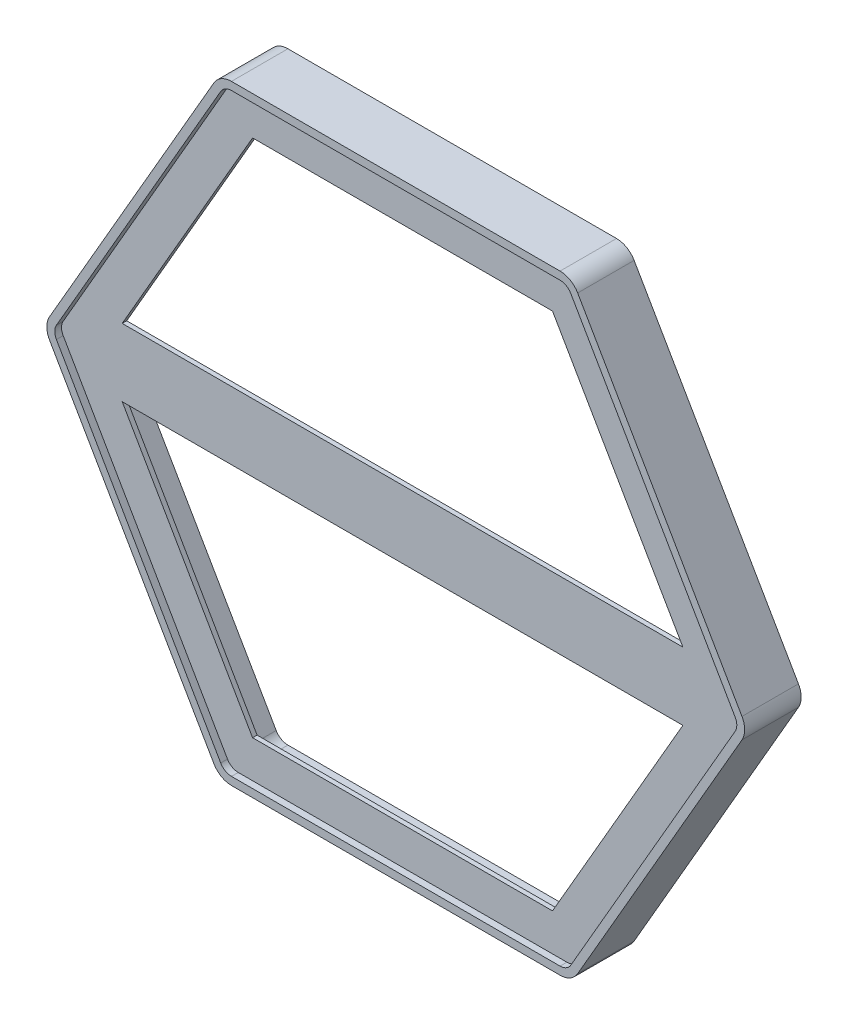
ISO-10303-21;
HEADER;
FILE_DESCRIPTION(('STEP AP214'),'2;1');
FILE_NAME('part.step','',(''),(''),'','','');
FILE_SCHEMA(('AUTOMOTIVE_DESIGN { 1 0 10303 214 1 1 1 1 }'));
ENDSEC;
DATA;
#1=APPLICATION_CONTEXT('core data for automotive mechanical design processes');
#2=APPLICATION_PROTOCOL_DEFINITION('international standard','automotive_design',2000,#1);
#3=PRODUCT_CONTEXT('',#1,'mechanical');
#4=PRODUCT('Part','Part','',(#3));
#5=PRODUCT_RELATED_PRODUCT_CATEGORY('part','',(#4));
#6=PRODUCT_DEFINITION_FORMATION('','',#4);
#7=PRODUCT_DEFINITION_CONTEXT('part definition',#1,'design');
#8=PRODUCT_DEFINITION('design','',#6,#7);
#9=PRODUCT_DEFINITION_SHAPE('','',#8);
#10=(LENGTH_UNIT() NAMED_UNIT(*) SI_UNIT(.MILLI.,.METRE.));
#11=(NAMED_UNIT(*) PLANE_ANGLE_UNIT() SI_UNIT($,.RADIAN.));
#12=(NAMED_UNIT(*) SI_UNIT($,.STERADIAN.) SOLID_ANGLE_UNIT());
#13=UNCERTAINTY_MEASURE_WITH_UNIT(LENGTH_MEASURE(1.E-05),#10,'distance_accuracy_value','');
#14=(GEOMETRIC_REPRESENTATION_CONTEXT(3) GLOBAL_UNCERTAINTY_ASSIGNED_CONTEXT((#13)) GLOBAL_UNIT_ASSIGNED_CONTEXT((#10,
#11,#12)) REPRESENTATION_CONTEXT('',''));
#15=CARTESIAN_POINT('',(0.,0.,0.));
#16=DIRECTION('',(0.,0.,1.));
#17=DIRECTION('',(1.,0.,0.));
#18=AXIS2_PLACEMENT_3D('',#15,#16,#17);
#19=CARTESIAN_POINT('',(157.645491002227,19.05,-25.4));
#20=DIRECTION('',(0.866025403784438,0.5,0.));
#21=DIRECTION('',(-0.5,0.866025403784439,0.));
#22=AXIS2_PLACEMENT_3D('',#19,#20,#21);
#23=PLANE('',#22);
#24=DIRECTION('',(0.5,-0.866025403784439,0.));
#25=VECTOR('',#24,1.);
#26=CARTESIAN_POINT('',(157.645491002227,19.05,2.54));
#27=LINE('',#26,#25);
#28=CARTESIAN_POINT('',(84.3220068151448,146.05,2.54));
#29=VERTEX_POINT('',#28);
#30=CARTESIAN_POINT('',(157.645491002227,19.05,2.54));
#31=VERTEX_POINT('',#30);
#32=EDGE_CURVE('E424',#29,#31,#27,.T.);
#33=ORIENTED_EDGE('',*,*,#32,.F.);
#34=DIRECTION('',(0.,0.,1.));
#35=VECTOR('',#34,1.);
#36=CARTESIAN_POINT('',(84.3220068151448,146.05,-25.4));
#37=LINE('',#36,#35);
#38=CARTESIAN_POINT('',(84.3220068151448,146.05,0.));
#39=VERTEX_POINT('',#38);
#40=EDGE_CURVE('E430',#39,#29,#37,.T.);
#41=ORIENTED_EDGE('',*,*,#40,.F.);
#42=DIRECTION('',(-0.5,0.866025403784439,0.));
#43=VECTOR('',#42,1.);
#44=CARTESIAN_POINT('',(218.870600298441,-86.9949999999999,0.));
#45=LINE('',#44,#43);
#46=CARTESIAN_POINT('',(157.645491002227,19.05,0.));
#47=VERTEX_POINT('',#46);
#48=EDGE_CURVE('E630',#47,#39,#45,.T.);
#49=ORIENTED_EDGE('',*,*,#48,.F.);
#50=DIRECTION('',(0.,0.,1.));
#51=VECTOR('',#50,1.);
#52=CARTESIAN_POINT('',(157.645491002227,19.05,-25.4));
#53=LINE('',#52,#51);
#54=EDGE_CURVE('E439',#47,#31,#53,.T.);
#55=ORIENTED_EDGE('',*,*,#54,.T.);
#56=EDGE_LOOP('',(#33,#41,#49,#55));
#57=FACE_BOUND('',#56,.T.);
#58=ADVANCED_FACE('F31',(#57),#23,.F.);
#59=CARTESIAN_POINT('',(-157.645491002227,19.05,-25.4));
#60=DIRECTION('',(0.,-1.,0.));
#61=DIRECTION('',(0.,0.,-1.));
#62=AXIS2_PLACEMENT_3D('',#59,#60,#61);
#63=PLANE('',#62);
#64=DIRECTION('',(-1.,0.,0.));
#65=VECTOR('',#64,1.);
#66=CARTESIAN_POINT('',(-157.645491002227,19.05,2.54));
#67=LINE('',#66,#65);
#68=CARTESIAN_POINT('',(-157.645491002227,19.05,2.54));
#69=VERTEX_POINT('',#68);
#70=EDGE_CURVE('E422',#31,#69,#67,.T.);
#71=ORIENTED_EDGE('',*,*,#70,.F.);
#72=ORIENTED_EDGE('',*,*,#54,.F.);
#73=DIRECTION('',(1.,0.,0.));
#74=VECTOR('',#73,1.);
#75=CARTESIAN_POINT('',(92.3875900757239,19.05,0.));
#76=LINE('',#75,#74);
#77=CARTESIAN_POINT('',(-157.645491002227,19.05,0.));
#78=VERTEX_POINT('',#77);
#79=EDGE_CURVE('E627',#78,#47,#76,.T.);
#80=ORIENTED_EDGE('',*,*,#79,.F.);
#81=DIRECTION('',(0.,0.,1.));
#82=VECTOR('',#81,1.);
#83=CARTESIAN_POINT('',(-157.645491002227,19.05,-25.4));
#84=LINE('',#83,#82);
#85=EDGE_CURVE('E443',#78,#69,#84,.T.);
#86=ORIENTED_EDGE('',*,*,#85,.T.);
#87=EDGE_LOOP('',(#71,#72,#80,#86));
#88=FACE_BOUND('',#87,.T.);
#89=ADVANCED_FACE('F673',(#88),#63,.F.);
#90=CARTESIAN_POINT('',(-84.3220068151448,146.05,-25.4));
#91=DIRECTION('',(-0.866025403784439,0.5,0.));
#92=DIRECTION('',(-0.5,-0.866025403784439,0.));
#93=AXIS2_PLACEMENT_3D('',#90,#91,#92);
#94=PLANE('',#93);
#95=DIRECTION('',(0.5,0.866025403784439,0.));
#96=VECTOR('',#95,1.);
#97=CARTESIAN_POINT('',(-84.3220068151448,146.05,2.54));
#98=LINE('',#97,#96);
#99=CARTESIAN_POINT('',(-84.3220068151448,146.05,2.54));
#100=VERTEX_POINT('',#99);
#101=EDGE_CURVE('E54',#69,#100,#98,.T.);
#102=ORIENTED_EDGE('',*,*,#101,.F.);
#103=ORIENTED_EDGE('',*,*,#85,.F.);
#104=DIRECTION('',(-0.5,-0.866025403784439,0.));
#105=VECTOR('',#104,1.);
#106=CARTESIAN_POINT('',(-172.676805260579,-6.98499999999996,0.));
#107=LINE('',#106,#105);
#108=CARTESIAN_POINT('',(-84.3220068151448,146.05,0.));
#109=VERTEX_POINT('',#108);
#110=EDGE_CURVE('E624',#109,#78,#107,.T.);
#111=ORIENTED_EDGE('',*,*,#110,.F.);
#112=DIRECTION('',(0.,0.,1.));
#113=VECTOR('',#112,1.);
#114=CARTESIAN_POINT('',(-84.3220068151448,146.05,-25.4));
#115=LINE('',#114,#113);
#116=EDGE_CURVE('E446',#109,#100,#115,.T.);
#117=ORIENTED_EDGE('',*,*,#116,.T.);
#118=EDGE_LOOP('',(#102,#103,#111,#117));
#119=FACE_BOUND('',#118,.T.);
#120=ADVANCED_FACE('F679',(#119),#94,.F.);
#121=CARTESIAN_POINT('',(84.3220068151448,146.05,-25.4));
#122=DIRECTION('',(0.,1.,0.));
#123=DIRECTION('',(-1.,0.,0.));
#124=AXIS2_PLACEMENT_3D('',#121,#122,#123);
#125=PLANE('',#124);
#126=DIRECTION('',(1.,0.,0.));
#127=VECTOR('',#126,1.);
#128=CARTESIAN_POINT('',(84.3220068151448,146.05,2.54));
#129=LINE('',#128,#127);
#130=EDGE_CURVE('E419',#100,#29,#129,.T.);
#131=ORIENTED_EDGE('',*,*,#130,.F.);
#132=ORIENTED_EDGE('',*,*,#116,.F.);
#133=DIRECTION('',(-1.,0.,0.));
#134=VECTOR('',#133,1.);
#135=CARTESIAN_POINT('',(92.3875900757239,146.05,0.));
#136=LINE('',#135,#134);
#137=EDGE_CURVE('E621',#39,#109,#136,.T.);
#138=ORIENTED_EDGE('',*,*,#137,.F.);
#139=ORIENTED_EDGE('',*,*,#40,.T.);
#140=EDGE_LOOP('',(#131,#132,#138,#139));
#141=FACE_BOUND('',#140,.T.);
#142=ADVANCED_FACE('F685',(#141),#125,.F.);
#143=CARTESIAN_POINT('',(84.3220068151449,-146.05,-25.4));
#144=DIRECTION('',(0.866025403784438,-0.5,0.));
#145=DIRECTION('',(0.5,0.866025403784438,0.));
#146=AXIS2_PLACEMENT_3D('',#143,#144,#145);
#147=PLANE('',#146);
#148=DIRECTION('',(-0.5,-0.866025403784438,0.));
#149=VECTOR('',#148,1.);
#150=CARTESIAN_POINT('',(84.3220068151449,-146.05,2.54));
#151=LINE('',#150,#149);
#152=CARTESIAN_POINT('',(157.645491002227,-19.05,2.54));
#153=VERTEX_POINT('',#152);
#154=CARTESIAN_POINT('',(84.3220068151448,-146.05,2.54));
#155=VERTEX_POINT('',#154);
#156=EDGE_CURVE('E417',#153,#155,#151,.T.);
#157=ORIENTED_EDGE('',*,*,#156,.F.);
#158=DIRECTION('',(0.,0.,1.));
#159=VECTOR('',#158,1.);
#160=CARTESIAN_POINT('',(157.645491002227,-19.05,-25.4));
#161=LINE('',#160,#159);
#162=CARTESIAN_POINT('',(157.645491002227,-19.05,0.));
#163=VERTEX_POINT('',#162);
#164=EDGE_CURVE('E426',#163,#153,#161,.T.);
#165=ORIENTED_EDGE('',*,*,#164,.F.);
#166=DIRECTION('',(0.5,0.866025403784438,0.));
#167=VECTOR('',#166,1.);
#168=CARTESIAN_POINT('',(80.2892151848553,-153.035,0.));
#169=LINE('',#168,#167);
#170=CARTESIAN_POINT('',(84.3220068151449,-146.05,0.));
#171=VERTEX_POINT('',#170);
#172=EDGE_CURVE('E39',#171,#163,#169,.T.);
#173=ORIENTED_EDGE('',*,*,#172,.F.);
#174=DIRECTION('',(0.,0.,1.));
#175=VECTOR('',#174,1.);
#176=CARTESIAN_POINT('',(84.3220068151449,-146.05,-25.4));
#177=LINE('',#176,#175);
#178=EDGE_CURVE('E427',#171,#155,#177,.T.);
#179=ORIENTED_EDGE('',*,*,#178,.T.);
#180=EDGE_LOOP('',(#157,#165,#173,#179));
#181=FACE_BOUND('',#180,.T.);
#182=ADVANCED_FACE('F649',(#181),#147,.F.);
#183=CARTESIAN_POINT('',(-84.3220068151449,-146.05,-25.4));
#184=DIRECTION('',(0.,-1.,0.));
#185=DIRECTION('',(1.,0.,0.));
#186=AXIS2_PLACEMENT_3D('',#183,#184,#185);
#187=PLANE('',#186);
#188=DIRECTION('',(-1.,0.,0.));
#189=VECTOR('',#188,1.);
#190=CARTESIAN_POINT('',(-84.3220068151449,-146.05,2.54));
#191=LINE('',#190,#189);
#192=CARTESIAN_POINT('',(-84.3220068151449,-146.05,2.54));
#193=VERTEX_POINT('',#192);
#194=EDGE_CURVE('E415',#155,#193,#191,.T.);
#195=ORIENTED_EDGE('',*,*,#194,.F.);
#196=ORIENTED_EDGE('',*,*,#178,.F.);
#197=DIRECTION('',(1.,0.,0.));
#198=VECTOR('',#197,1.);
#199=CARTESIAN_POINT('',(92.3875900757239,-146.05,0.));
#200=LINE('',#199,#198);
#201=CARTESIAN_POINT('',(-84.3220068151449,-146.05,0.));
#202=VERTEX_POINT('',#201);
#203=EDGE_CURVE('E639',#202,#171,#200,.T.);
#204=ORIENTED_EDGE('',*,*,#203,.F.);
#205=DIRECTION('',(0.,0.,1.));
#206=VECTOR('',#205,1.);
#207=CARTESIAN_POINT('',(-84.3220068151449,-146.05,-25.4));
#208=LINE('',#207,#206);
#209=EDGE_CURVE('E431',#202,#193,#208,.T.);
#210=ORIENTED_EDGE('',*,*,#209,.T.);
#211=EDGE_LOOP('',(#195,#196,#204,#210));
#212=FACE_BOUND('',#211,.T.);
#213=ADVANCED_FACE('F652',(#212),#187,.F.);
#214=CARTESIAN_POINT('',(-157.645491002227,-19.05,-25.4));
#215=DIRECTION('',(-0.866025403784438,-0.5,0.));
#216=DIRECTION('',(0.5,-0.866025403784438,0.));
#217=AXIS2_PLACEMENT_3D('',#214,#215,#216);
#218=PLANE('',#217);
#219=DIRECTION('',(-0.5,0.866025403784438,0.));
#220=VECTOR('',#219,1.);
#221=CARTESIAN_POINT('',(-157.645491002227,-19.05,2.54));
#222=LINE('',#221,#220);
#223=CARTESIAN_POINT('',(-157.645491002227,-19.05,2.54));
#224=VERTEX_POINT('',#223);
#225=EDGE_CURVE('E394',#193,#224,#222,.T.);
#226=ORIENTED_EDGE('',*,*,#225,.F.);
#227=ORIENTED_EDGE('',*,*,#209,.F.);
#228=DIRECTION('',(0.5,-0.866025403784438,0.));
#229=VECTOR('',#228,1.);
#230=CARTESIAN_POINT('',(-34.0954201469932,-233.045,0.));
#231=LINE('',#230,#229);
#232=CARTESIAN_POINT('',(-157.645491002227,-19.05,0.));
#233=VERTEX_POINT('',#232);
#234=EDGE_CURVE('E636',#233,#202,#231,.T.);
#235=ORIENTED_EDGE('',*,*,#234,.F.);
#236=DIRECTION('',(0.,0.,1.));
#237=VECTOR('',#236,1.);
#238=CARTESIAN_POINT('',(-157.645491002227,-19.05,-25.4));
#239=LINE('',#238,#237);
#240=EDGE_CURVE('E434',#233,#224,#239,.T.);
#241=ORIENTED_EDGE('',*,*,#240,.T.);
#242=EDGE_LOOP('',(#226,#227,#235,#241));
#243=FACE_BOUND('',#242,.T.);
#244=ADVANCED_FACE('F658',(#243),#218,.F.);
#245=CARTESIAN_POINT('',(-157.645491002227,-19.05,-25.4));
#246=DIRECTION('',(0.,1.,0.));
#247=DIRECTION('',(0.,0.,1.));
#248=AXIS2_PLACEMENT_3D('',#245,#246,#247);
#249=PLANE('',#248);
#250=DIRECTION('',(1.,0.,0.));
#251=VECTOR('',#250,1.);
#252=CARTESIAN_POINT('',(-157.645491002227,-19.05,2.54));
#253=LINE('',#252,#251);
#254=EDGE_CURVE('E11',#224,#153,#253,.T.);
#255=ORIENTED_EDGE('',*,*,#254,.F.);
#256=ORIENTED_EDGE('',*,*,#240,.F.);
#257=DIRECTION('',(-1.,0.,0.));
#258=VECTOR('',#257,1.);
#259=CARTESIAN_POINT('',(92.3875900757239,-19.05,0.));
#260=LINE('',#259,#258);
#261=EDGE_CURVE('E633',#163,#233,#260,.T.);
#262=ORIENTED_EDGE('',*,*,#261,.F.);
#263=ORIENTED_EDGE('',*,*,#164,.T.);
#264=EDGE_LOOP('',(#255,#256,#262,#263));
#265=FACE_BOUND('',#264,.T.);
#266=ADVANCED_FACE('F661',(#265),#249,.F.);
#267=CARTESIAN_POINT('',(92.3875900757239,-160.02,6.35));
#268=DIRECTION('',(0.,0.,-1.));
#269=DIRECTION('',(-1.,0.,0.));
#270=AXIS2_PLACEMENT_3D('',#267,#268,#269);
#271=CYLINDRICAL_SURFACE('',#270,11.43);
#272=DIRECTION('',(0.,0.,-1.));
#273=VECTOR('',#272,1.);
#274=CARTESIAN_POINT('',(92.3875900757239,-171.45,6.35));
#275=LINE('',#274,#273);
#276=CARTESIAN_POINT('',(92.3875900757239,-171.45,6.35));
#277=VERTEX_POINT('',#276);
#278=CARTESIAN_POINT('',(92.3875900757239,-171.45,-25.4));
#279=VERTEX_POINT('',#278);
#280=EDGE_CURVE('E597',#277,#279,#275,.T.);
#281=ORIENTED_EDGE('',*,*,#280,.T.);
#282=CARTESIAN_POINT('',(92.3875900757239,-160.02,-25.4));
#283=DIRECTION('',(0.,0.,-1.));
#284=DIRECTION('',(-1.,0.,0.));
#285=AXIS2_PLACEMENT_3D('',#282,#283,#284);
#286=CIRCLE('',#285,11.43);
#287=CARTESIAN_POINT('',(102.28626044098,-165.735,-25.4));
#288=VERTEX_POINT('',#287);
#289=EDGE_CURVE('E548',#288,#279,#286,.T.);
#290=ORIENTED_EDGE('',*,*,#289,.F.);
#291=DIRECTION('',(0.,0.,-1.));
#292=VECTOR('',#291,1.);
#293=CARTESIAN_POINT('',(102.28626044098,-165.735,6.35));
#294=LINE('',#293,#292);
#295=CARTESIAN_POINT('',(102.28626044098,-165.735,6.35));
#296=VERTEX_POINT('',#295);
#297=EDGE_CURVE('E619',#296,#288,#294,.T.);
#298=ORIENTED_EDGE('',*,*,#297,.F.);
#299=CARTESIAN_POINT('',(92.3875900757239,-160.02,6.35));
#300=DIRECTION('',(0.,0.,1.));
#301=DIRECTION('',(1.,0.,0.));
#302=AXIS2_PLACEMENT_3D('',#299,#300,#301);
#303=CIRCLE('',#302,11.43);
#304=EDGE_CURVE('E572',#277,#296,#303,.T.);
#305=ORIENTED_EDGE('',*,*,#304,.F.);
#306=EDGE_LOOP('',(#281,#290,#298,#305));
#307=FACE_BOUND('',#306,.T.);
#308=ADVANCED_FACE('F33',(#307),#271,.T.);
#309=CARTESIAN_POINT('',(102.28626044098,-165.735,6.35));
#310=DIRECTION('',(-0.866025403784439,0.5,0.));
#311=DIRECTION('',(-0.5,-0.866025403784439,0.));
#312=AXIS2_PLACEMENT_3D('',#309,#310,#311);
#313=PLANE('',#312);
#314=ORIENTED_EDGE('',*,*,#297,.T.);
#315=DIRECTION('',(-0.5,-0.866025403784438,0.));
#316=VECTOR('',#315,1.);
#317=CARTESIAN_POINT('',(102.28626044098,-165.735,-25.4));
#318=LINE('',#317,#316);
#319=CARTESIAN_POINT('',(194.673850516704,-5.71500000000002,-25.4));
#320=VERTEX_POINT('',#319);
#321=EDGE_CURVE('E545',#320,#288,#318,.T.);
#322=ORIENTED_EDGE('',*,*,#321,.F.);
#323=DIRECTION('',(0.,0.,-1.));
#324=VECTOR('',#323,1.);
#325=CARTESIAN_POINT('',(194.673850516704,-5.71500000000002,6.35));
#326=LINE('',#325,#324);
#327=CARTESIAN_POINT('',(194.673850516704,-5.71500000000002,6.35));
#328=VERTEX_POINT('',#327);
#329=EDGE_CURVE('E617',#328,#320,#326,.T.);
#330=ORIENTED_EDGE('',*,*,#329,.F.);
#331=DIRECTION('',(0.5,0.866025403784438,0.));
#332=VECTOR('',#331,1.);
#333=CARTESIAN_POINT('',(102.28626044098,-165.735,6.35));
#334=LINE('',#333,#332);
#335=EDGE_CURVE('E575',#296,#328,#334,.T.);
#336=ORIENTED_EDGE('',*,*,#335,.F.);
#337=EDGE_LOOP('',(#314,#322,#330,#336));
#338=FACE_BOUND('',#337,.T.);
#339=ADVANCED_FACE('F668',(#338),#313,.F.);
#340=CARTESIAN_POINT('',(184.775180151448,0.,6.35));
#341=DIRECTION('',(0.,0.,-1.));
#342=DIRECTION('',(-1.,0.,0.));
#343=AXIS2_PLACEMENT_3D('',#340,#341,#342);
#344=CYLINDRICAL_SURFACE('',#343,11.4300000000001);
#345=ORIENTED_EDGE('',*,*,#329,.T.);
#346=CARTESIAN_POINT('',(184.775180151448,0.,-25.4));
#347=DIRECTION('',(0.,0.,-1.));
#348=DIRECTION('',(-1.,0.,0.));
#349=AXIS2_PLACEMENT_3D('',#346,#347,#348);
#350=CIRCLE('',#349,11.4300000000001);
#351=CARTESIAN_POINT('',(194.673850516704,5.71499999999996,-25.4));
#352=VERTEX_POINT('',#351);
#353=EDGE_CURVE('E542',#352,#320,#350,.T.);
#354=ORIENTED_EDGE('',*,*,#353,.F.);
#355=DIRECTION('',(0.,0.,-1.));
#356=VECTOR('',#355,1.);
#357=CARTESIAN_POINT('',(194.673850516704,5.71499999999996,6.35));
#358=LINE('',#357,#356);
#359=CARTESIAN_POINT('',(194.673850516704,5.71499999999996,6.35));
#360=VERTEX_POINT('',#359);
#361=EDGE_CURVE('E615',#360,#352,#358,.T.);
#362=ORIENTED_EDGE('',*,*,#361,.F.);
#363=CARTESIAN_POINT('',(184.775180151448,0.,6.35));
#364=DIRECTION('',(0.,0.,1.));
#365=DIRECTION('',(1.,0.,0.));
#366=AXIS2_PLACEMENT_3D('',#363,#364,#365);
#367=CIRCLE('',#366,11.4300000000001);
#368=EDGE_CURVE('E577',#328,#360,#367,.T.);
#369=ORIENTED_EDGE('',*,*,#368,.F.);
#370=EDGE_LOOP('',(#345,#354,#362,#369));
#371=FACE_BOUND('',#370,.T.);
#372=ADVANCED_FACE('F780',(#371),#344,.T.);
#373=CARTESIAN_POINT('',(194.673850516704,5.71499999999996,6.35));
#374=DIRECTION('',(-0.866025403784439,-0.5,0.));
#375=DIRECTION('',(0.5,-0.866025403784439,0.));
#376=AXIS2_PLACEMENT_3D('',#373,#374,#375);
#377=PLANE('',#376);
#378=ORIENTED_EDGE('',*,*,#361,.T.);
#379=DIRECTION('',(0.5,-0.866025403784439,0.));
#380=VECTOR('',#379,1.);
#381=CARTESIAN_POINT('',(194.673850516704,5.71499999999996,-25.4));
#382=LINE('',#381,#380);
#383=CARTESIAN_POINT('',(102.28626044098,165.735,-25.4));
#384=VERTEX_POINT('',#383);
#385=EDGE_CURVE('E539',#384,#352,#382,.T.);
#386=ORIENTED_EDGE('',*,*,#385,.F.);
#387=DIRECTION('',(0.,0.,-1.));
#388=VECTOR('',#387,1.);
#389=CARTESIAN_POINT('',(102.28626044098,165.735,6.35));
#390=LINE('',#389,#388);
#391=CARTESIAN_POINT('',(102.28626044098,165.735,6.35));
#392=VERTEX_POINT('',#391);
#393=EDGE_CURVE('E613',#392,#384,#390,.T.);
#394=ORIENTED_EDGE('',*,*,#393,.F.);
#395=DIRECTION('',(-0.5,0.866025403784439,0.));
#396=VECTOR('',#395,1.);
#397=CARTESIAN_POINT('',(194.673850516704,5.71499999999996,6.35));
#398=LINE('',#397,#396);
#399=EDGE_CURVE('E579',#360,#392,#398,.T.);
#400=ORIENTED_EDGE('',*,*,#399,.F.);
#401=EDGE_LOOP('',(#378,#386,#394,#400));
#402=FACE_BOUND('',#401,.T.);
#403=ADVANCED_FACE('F776',(#402),#377,.F.);
#404=CARTESIAN_POINT('',(92.3875900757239,160.02,6.35));
#405=DIRECTION('',(0.,0.,-1.));
#406=DIRECTION('',(-1.,0.,0.));
#407=AXIS2_PLACEMENT_3D('',#404,#405,#406);
#408=CYLINDRICAL_SURFACE('',#407,11.43);
#409=ORIENTED_EDGE('',*,*,#393,.T.);
#410=CARTESIAN_POINT('',(92.3875900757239,160.02,-25.4));
#411=DIRECTION('',(0.,0.,-1.));
#412=DIRECTION('',(-1.,0.,0.));
#413=AXIS2_PLACEMENT_3D('',#410,#411,#412);
#414=CIRCLE('',#413,11.43);
#415=CARTESIAN_POINT('',(92.3875900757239,171.45,-25.4));
#416=VERTEX_POINT('',#415);
#417=EDGE_CURVE('E536',#416,#384,#414,.T.);
#418=ORIENTED_EDGE('',*,*,#417,.F.);
#419=DIRECTION('',(0.,0.,-1.));
#420=VECTOR('',#419,1.);
#421=CARTESIAN_POINT('',(92.3875900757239,171.45,6.35));
#422=LINE('',#421,#420);
#423=CARTESIAN_POINT('',(92.3875900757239,171.45,6.35));
#424=VERTEX_POINT('',#423);
#425=EDGE_CURVE('E611',#424,#416,#422,.T.);
#426=ORIENTED_EDGE('',*,*,#425,.F.);
#427=CARTESIAN_POINT('',(92.3875900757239,160.02,6.35));
#428=DIRECTION('',(0.,0.,1.));
#429=DIRECTION('',(1.,0.,0.));
#430=AXIS2_PLACEMENT_3D('',#427,#428,#429);
#431=CIRCLE('',#430,11.43);
#432=EDGE_CURVE('E581',#392,#424,#431,.T.);
#433=ORIENTED_EDGE('',*,*,#432,.F.);
#434=EDGE_LOOP('',(#409,#418,#426,#433));
#435=FACE_BOUND('',#434,.T.);
#436=ADVANCED_FACE('F772',(#435),#408,.T.);
#437=CARTESIAN_POINT('',(92.3875900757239,171.45,6.35));
#438=DIRECTION('',(0.,-1.,0.));
#439=DIRECTION('',(1.,0.,0.));
#440=AXIS2_PLACEMENT_3D('',#437,#438,#439);
#441=PLANE('',#440);
#442=ORIENTED_EDGE('',*,*,#425,.T.);
#443=DIRECTION('',(1.,0.,0.));
#444=VECTOR('',#443,1.);
#445=CARTESIAN_POINT('',(92.3875900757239,171.45,-25.4));
#446=LINE('',#445,#444);
#447=CARTESIAN_POINT('',(-92.3875900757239,171.45,-25.4));
#448=VERTEX_POINT('',#447);
#449=EDGE_CURVE('E569',#448,#416,#446,.T.);
#450=ORIENTED_EDGE('',*,*,#449,.F.);
#451=DIRECTION('',(0.,0.,-1.));
#452=VECTOR('',#451,1.);
#453=CARTESIAN_POINT('',(-92.3875900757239,171.45,6.35));
#454=LINE('',#453,#452);
#455=CARTESIAN_POINT('',(-92.3875900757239,171.45,6.35));
#456=VERTEX_POINT('',#455);
#457=EDGE_CURVE('E609',#456,#448,#454,.T.);
#458=ORIENTED_EDGE('',*,*,#457,.F.);
#459=DIRECTION('',(-1.,0.,0.));
#460=VECTOR('',#459,1.);
#461=CARTESIAN_POINT('',(92.3875900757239,171.45,6.35));
#462=LINE('',#461,#460);
#463=EDGE_CURVE('E583',#424,#456,#462,.T.);
#464=ORIENTED_EDGE('',*,*,#463,.F.);
#465=EDGE_LOOP('',(#442,#450,#458,#464));
#466=FACE_BOUND('',#465,.T.);
#467=ADVANCED_FACE('F768',(#466),#441,.F.);
#468=CARTESIAN_POINT('',(-92.3875900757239,160.02,6.35));
#469=DIRECTION('',(0.,0.,-1.));
#470=DIRECTION('',(-1.,0.,0.));
#471=AXIS2_PLACEMENT_3D('',#468,#469,#470);
#472=CYLINDRICAL_SURFACE('',#471,11.43);
#473=ORIENTED_EDGE('',*,*,#457,.T.);
#474=CARTESIAN_POINT('',(-92.3875900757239,160.02,-25.4));
#475=DIRECTION('',(0.,0.,-1.));
#476=DIRECTION('',(-1.,0.,0.));
#477=AXIS2_PLACEMENT_3D('',#474,#475,#476);
#478=CIRCLE('',#477,11.43);
#479=CARTESIAN_POINT('',(-102.28626044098,165.735,-25.4));
#480=VERTEX_POINT('',#479);
#481=EDGE_CURVE('E566',#480,#448,#478,.T.);
#482=ORIENTED_EDGE('',*,*,#481,.F.);
#483=DIRECTION('',(0.,0.,-1.));
#484=VECTOR('',#483,1.);
#485=CARTESIAN_POINT('',(-102.28626044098,165.735,6.35));
#486=LINE('',#485,#484);
#487=CARTESIAN_POINT('',(-102.28626044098,165.735,6.35));
#488=VERTEX_POINT('',#487);
#489=EDGE_CURVE('E607',#488,#480,#486,.T.);
#490=ORIENTED_EDGE('',*,*,#489,.F.);
#491=CARTESIAN_POINT('',(-92.3875900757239,160.02,6.35));
#492=DIRECTION('',(0.,0.,1.));
#493=DIRECTION('',(1.,0.,0.));
#494=AXIS2_PLACEMENT_3D('',#491,#492,#493);
#495=CIRCLE('',#494,11.43);
#496=EDGE_CURVE('E585',#456,#488,#495,.T.);
#497=ORIENTED_EDGE('',*,*,#496,.F.);
#498=EDGE_LOOP('',(#473,#482,#490,#497));
#499=FACE_BOUND('',#498,.T.);
#500=ADVANCED_FACE('F764',(#499),#472,.T.);
#501=CARTESIAN_POINT('',(-102.28626044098,165.735,6.35));
#502=DIRECTION('',(0.866025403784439,-0.5,0.));
#503=DIRECTION('',(0.5,0.866025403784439,0.));
#504=AXIS2_PLACEMENT_3D('',#501,#502,#503);
#505=PLANE('',#504);
#506=ORIENTED_EDGE('',*,*,#489,.T.);
#507=DIRECTION('',(0.5,0.866025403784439,0.));
#508=VECTOR('',#507,1.);
#509=CARTESIAN_POINT('',(-102.28626044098,165.735,-25.4));
#510=LINE('',#509,#508);
#511=CARTESIAN_POINT('',(-194.673850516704,5.71499999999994,-25.4));
#512=VERTEX_POINT('',#511);
#513=EDGE_CURVE('E563',#512,#480,#510,.T.);
#514=ORIENTED_EDGE('',*,*,#513,.F.);
#515=DIRECTION('',(0.,0.,-1.));
#516=VECTOR('',#515,1.);
#517=CARTESIAN_POINT('',(-194.673850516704,5.71499999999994,6.35));
#518=LINE('',#517,#516);
#519=CARTESIAN_POINT('',(-194.673850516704,5.71499999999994,6.35));
#520=VERTEX_POINT('',#519);
#521=EDGE_CURVE('E605',#520,#512,#518,.T.);
#522=ORIENTED_EDGE('',*,*,#521,.F.);
#523=DIRECTION('',(-0.5,-0.866025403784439,0.));
#524=VECTOR('',#523,1.);
#525=CARTESIAN_POINT('',(-102.28626044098,165.735,6.35));
#526=LINE('',#525,#524);
#527=EDGE_CURVE('E587',#488,#520,#526,.T.);
#528=ORIENTED_EDGE('',*,*,#527,.F.);
#529=EDGE_LOOP('',(#506,#514,#522,#528));
#530=FACE_BOUND('',#529,.T.);
#531=ADVANCED_FACE('F760',(#530),#505,.F.);
#532=CARTESIAN_POINT('',(-184.775180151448,0.,6.35));
#533=DIRECTION('',(0.,0.,-1.));
#534=DIRECTION('',(-1.,0.,0.));
#535=AXIS2_PLACEMENT_3D('',#532,#533,#534);
#536=CYLINDRICAL_SURFACE('',#535,11.43);
#537=ORIENTED_EDGE('',*,*,#521,.T.);
#538=CARTESIAN_POINT('',(-184.775180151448,0.,-25.4));
#539=DIRECTION('',(0.,0.,-1.));
#540=DIRECTION('',(-1.,0.,0.));
#541=AXIS2_PLACEMENT_3D('',#538,#539,#540);
#542=CIRCLE('',#541,11.43);
#543=CARTESIAN_POINT('',(-194.673850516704,-5.71500000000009,-25.4));
#544=VERTEX_POINT('',#543);
#545=EDGE_CURVE('E560',#544,#512,#542,.T.);
#546=ORIENTED_EDGE('',*,*,#545,.F.);
#547=DIRECTION('',(0.,0.,-1.));
#548=VECTOR('',#547,1.);
#549=CARTESIAN_POINT('',(-194.673850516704,-5.71500000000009,6.35));
#550=LINE('',#549,#548);
#551=CARTESIAN_POINT('',(-194.673850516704,-5.71500000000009,6.35));
#552=VERTEX_POINT('',#551);
#553=EDGE_CURVE('E603',#552,#544,#550,.T.);
#554=ORIENTED_EDGE('',*,*,#553,.F.);
#555=CARTESIAN_POINT('',(-184.775180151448,0.,6.35));
#556=DIRECTION('',(0.,0.,1.));
#557=DIRECTION('',(1.,0.,0.));
#558=AXIS2_PLACEMENT_3D('',#555,#556,#557);
#559=CIRCLE('',#558,11.43);
#560=EDGE_CURVE('E589',#520,#552,#559,.T.);
#561=ORIENTED_EDGE('',*,*,#560,.F.);
#562=EDGE_LOOP('',(#537,#546,#554,#561));
#563=FACE_BOUND('',#562,.T.);
#564=ADVANCED_FACE('F756',(#563),#536,.T.);
#565=CARTESIAN_POINT('',(-194.673850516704,-5.71500000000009,6.35));
#566=DIRECTION('',(0.866025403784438,0.5,0.));
#567=DIRECTION('',(-0.5,0.866025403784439,0.));
#568=AXIS2_PLACEMENT_3D('',#565,#566,#567);
#569=PLANE('',#568);
#570=ORIENTED_EDGE('',*,*,#553,.T.);
#571=DIRECTION('',(-0.5,0.866025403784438,0.));
#572=VECTOR('',#571,1.);
#573=CARTESIAN_POINT('',(-194.673850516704,-5.71500000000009,-25.4));
#574=LINE('',#573,#572);
#575=CARTESIAN_POINT('',(-102.28626044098,-165.735,-25.4));
#576=VERTEX_POINT('',#575);
#577=EDGE_CURVE('E557',#576,#544,#574,.T.);
#578=ORIENTED_EDGE('',*,*,#577,.F.);
#579=DIRECTION('',(0.,0.,-1.));
#580=VECTOR('',#579,1.);
#581=CARTESIAN_POINT('',(-102.28626044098,-165.735,6.35));
#582=LINE('',#581,#580);
#583=CARTESIAN_POINT('',(-102.28626044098,-165.735,6.35));
#584=VERTEX_POINT('',#583);
#585=EDGE_CURVE('E601',#584,#576,#582,.T.);
#586=ORIENTED_EDGE('',*,*,#585,.F.);
#587=DIRECTION('',(0.5,-0.866025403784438,0.));
#588=VECTOR('',#587,1.);
#589=CARTESIAN_POINT('',(-194.673850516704,-5.71500000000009,6.35));
#590=LINE('',#589,#588);
#591=EDGE_CURVE('E591',#552,#584,#590,.T.);
#592=ORIENTED_EDGE('',*,*,#591,.F.);
#593=EDGE_LOOP('',(#570,#578,#586,#592));
#594=FACE_BOUND('',#593,.T.);
#595=ADVANCED_FACE('F752',(#594),#569,.F.);
#596=CARTESIAN_POINT('',(-92.3875900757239,-160.02,6.35));
#597=DIRECTION('',(0.,0.,-1.));
#598=DIRECTION('',(-1.,0.,0.));
#599=AXIS2_PLACEMENT_3D('',#596,#597,#598);
#600=CYLINDRICAL_SURFACE('',#599,11.43);
#601=ORIENTED_EDGE('',*,*,#585,.T.);
#602=CARTESIAN_POINT('',(-92.3875900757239,-160.02,-25.4));
#603=DIRECTION('',(0.,0.,-1.));
#604=DIRECTION('',(-1.,0.,0.));
#605=AXIS2_PLACEMENT_3D('',#602,#603,#604);
#606=CIRCLE('',#605,11.43);
#607=CARTESIAN_POINT('',(-92.3875900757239,-171.45,-25.4));
#608=VERTEX_POINT('',#607);
#609=EDGE_CURVE('E554',#608,#576,#606,.T.);
#610=ORIENTED_EDGE('',*,*,#609,.F.);
#611=DIRECTION('',(0.,0.,-1.));
#612=VECTOR('',#611,1.);
#613=CARTESIAN_POINT('',(-92.3875900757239,-171.45,6.35));
#614=LINE('',#613,#612);
#615=CARTESIAN_POINT('',(-92.3875900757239,-171.45,6.35));
#616=VERTEX_POINT('',#615);
#617=EDGE_CURVE('E599',#616,#608,#614,.T.);
#618=ORIENTED_EDGE('',*,*,#617,.F.);
#619=CARTESIAN_POINT('',(-92.3875900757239,-160.02,6.35));
#620=DIRECTION('',(0.,0.,1.));
#621=DIRECTION('',(1.,0.,0.));
#622=AXIS2_PLACEMENT_3D('',#619,#620,#621);
#623=CIRCLE('',#622,11.43);
#624=EDGE_CURVE('E593',#584,#616,#623,.T.);
#625=ORIENTED_EDGE('',*,*,#624,.F.);
#626=EDGE_LOOP('',(#601,#610,#618,#625));
#627=FACE_BOUND('',#626,.T.);
#628=ADVANCED_FACE('F748',(#627),#600,.T.);
#629=CARTESIAN_POINT('',(-92.3875900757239,-171.45,6.35));
#630=DIRECTION('',(0.,1.,0.));
#631=DIRECTION('',(-1.,0.,0.));
#632=AXIS2_PLACEMENT_3D('',#629,#630,#631);
#633=PLANE('',#632);
#634=ORIENTED_EDGE('',*,*,#617,.T.);
#635=DIRECTION('',(-1.,0.,0.));
#636=VECTOR('',#635,1.);
#637=CARTESIAN_POINT('',(-92.3875900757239,-171.45,-25.4));
#638=LINE('',#637,#636);
#639=EDGE_CURVE('E551',#279,#608,#638,.T.);
#640=ORIENTED_EDGE('',*,*,#639,.F.);
#641=ORIENTED_EDGE('',*,*,#280,.F.);
#642=DIRECTION('',(1.,0.,0.));
#643=VECTOR('',#642,1.);
#644=CARTESIAN_POINT('',(-92.3875900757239,-171.45,6.35));
#645=LINE('',#644,#643);
#646=EDGE_CURVE('E595',#616,#277,#645,.T.);
#647=ORIENTED_EDGE('',*,*,#646,.F.);
#648=EDGE_LOOP('',(#634,#640,#641,#647));
#649=FACE_BOUND('',#648,.T.);
#650=ADVANCED_FACE('F742',(#649),#633,.F.);
#651=CARTESIAN_POINT('',(92.3875900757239,-160.02,6.35));
#652=DIRECTION('',(0.,0.,1.));
#653=DIRECTION('',(1.,0.,0.));
#654=AXIS2_PLACEMENT_3D('',#651,#652,#653);
#655=PLANE('',#654);
#656=CARTESIAN_POINT('',(184.775180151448,0.,6.35));
#657=DIRECTION('',(0.,0.,1.));
#658=DIRECTION('',(1.,0.,0.));
#659=AXIS2_PLACEMENT_3D('',#656,#657,#658);
#660=CIRCLE('',#659,6.98500000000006);
#661=CARTESIAN_POINT('',(190.824367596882,-3.49250000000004,6.35));
#662=VERTEX_POINT('',#661);
#663=CARTESIAN_POINT('',(190.824367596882,3.49249999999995,6.35));
#664=VERTEX_POINT('',#663);
#665=EDGE_CURVE('E46',#662,#664,#660,.T.);
#666=ORIENTED_EDGE('',*,*,#665,.F.);
#667=DIRECTION('',(0.5,0.866025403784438,0.));
#668=VECTOR('',#667,1.);
#669=CARTESIAN_POINT('',(98.4367775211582,-163.5125,6.35));
#670=LINE('',#669,#668);
#671=CARTESIAN_POINT('',(98.4367775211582,-163.5125,6.35));
#672=VERTEX_POINT('',#671);
#673=EDGE_CURVE('E332',#672,#662,#670,.T.);
#674=ORIENTED_EDGE('',*,*,#673,.F.);
#675=CARTESIAN_POINT('',(92.3875900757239,-160.02,6.35));
#676=DIRECTION('',(0.,0.,1.));
#677=DIRECTION('',(1.,0.,0.));
#678=AXIS2_PLACEMENT_3D('',#675,#676,#677);
#679=CIRCLE('',#678,6.98499999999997);
#680=CARTESIAN_POINT('',(92.3875900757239,-167.005,6.35));
#681=VERTEX_POINT('',#680);
#682=EDGE_CURVE('E335',#681,#672,#679,.T.);
#683=ORIENTED_EDGE('',*,*,#682,.F.);
#684=DIRECTION('',(1.,0.,0.));
#685=VECTOR('',#684,1.);
#686=CARTESIAN_POINT('',(-92.3875900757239,-167.005,6.35));
#687=LINE('',#686,#685);
#688=CARTESIAN_POINT('',(-92.3875900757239,-167.005,6.35));
#689=VERTEX_POINT('',#688);
#690=EDGE_CURVE('E387',#689,#681,#687,.T.);
#691=ORIENTED_EDGE('',*,*,#690,.F.);
#692=CARTESIAN_POINT('',(-92.3875900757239,-160.02,6.35));
#693=DIRECTION('',(0.,0.,1.));
#694=DIRECTION('',(1.,0.,0.));
#695=AXIS2_PLACEMENT_3D('',#692,#693,#694);
#696=CIRCLE('',#695,6.98500000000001);
#697=CARTESIAN_POINT('',(-98.4367775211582,-163.5125,6.35));
#698=VERTEX_POINT('',#697);
#699=EDGE_CURVE('E384',#698,#689,#696,.T.);
#700=ORIENTED_EDGE('',*,*,#699,.F.);
#701=DIRECTION('',(0.5,-0.866025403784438,0.));
#702=VECTOR('',#701,1.);
#703=CARTESIAN_POINT('',(-190.824367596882,-3.49250000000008,6.35));
#704=LINE('',#703,#702);
#705=CARTESIAN_POINT('',(-190.824367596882,-3.49250000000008,6.35));
#706=VERTEX_POINT('',#705);
#707=EDGE_CURVE('E381',#706,#698,#704,.T.);
#708=ORIENTED_EDGE('',*,*,#707,.F.);
#709=CARTESIAN_POINT('',(-184.775180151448,0.,6.35));
#710=DIRECTION('',(0.,0.,1.));
#711=DIRECTION('',(1.,0.,0.));
#712=AXIS2_PLACEMENT_3D('',#709,#710,#711);
#713=CIRCLE('',#712,6.98500000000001);
#714=CARTESIAN_POINT('',(-190.824367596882,3.4924999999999,6.35));
#715=VERTEX_POINT('',#714);
#716=EDGE_CURVE('E378',#715,#706,#713,.T.);
#717=ORIENTED_EDGE('',*,*,#716,.F.);
#718=DIRECTION('',(-0.5,-0.866025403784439,0.));
#719=VECTOR('',#718,1.);
#720=CARTESIAN_POINT('',(-98.4367775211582,163.5125,6.35));
#721=LINE('',#720,#719);
#722=CARTESIAN_POINT('',(-98.4367775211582,163.5125,6.35));
#723=VERTEX_POINT('',#722);
#724=EDGE_CURVE('E375',#723,#715,#721,.T.);
#725=ORIENTED_EDGE('',*,*,#724,.F.);
#726=CARTESIAN_POINT('',(-92.3875900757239,160.02,6.35));
#727=DIRECTION('',(0.,0.,1.));
#728=DIRECTION('',(1.,0.,0.));
#729=AXIS2_PLACEMENT_3D('',#726,#727,#728);
#730=CIRCLE('',#729,6.985);
#731=CARTESIAN_POINT('',(-92.3875900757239,167.005,6.35));
#732=VERTEX_POINT('',#731);
#733=EDGE_CURVE('E372',#732,#723,#730,.T.);
#734=ORIENTED_EDGE('',*,*,#733,.F.);
#735=DIRECTION('',(-1.,0.,0.));
#736=VECTOR('',#735,1.);
#737=CARTESIAN_POINT('',(92.3875900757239,167.005,6.35));
#738=LINE('',#737,#736);
#739=CARTESIAN_POINT('',(92.3875900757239,167.005,6.35));
#740=VERTEX_POINT('',#739);
#741=EDGE_CURVE('E369',#740,#732,#738,.T.);
#742=ORIENTED_EDGE('',*,*,#741,.F.);
#743=CARTESIAN_POINT('',(92.3875900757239,160.02,6.35));
#744=DIRECTION('',(0.,0.,1.));
#745=DIRECTION('',(1.,0.,0.));
#746=AXIS2_PLACEMENT_3D('',#743,#744,#745);
#747=CIRCLE('',#746,6.98500000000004);
#748=CARTESIAN_POINT('',(98.4367775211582,163.5125,6.35));
#749=VERTEX_POINT('',#748);
#750=EDGE_CURVE('E366',#749,#740,#747,.T.);
#751=ORIENTED_EDGE('',*,*,#750,.F.);
#752=DIRECTION('',(-0.5,0.866025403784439,0.));
#753=VECTOR('',#752,1.);
#754=CARTESIAN_POINT('',(190.824367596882,3.49249999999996,6.35));
#755=LINE('',#754,#753);
#756=EDGE_CURVE('E364',#664,#749,#755,.T.);
#757=ORIENTED_EDGE('',*,*,#756,.F.);
#758=EDGE_LOOP('',(#666,#674,#683,#691,#700,#708,#717,#725,#734,#742,#751,#757));
#759=FACE_BOUND('',#758,.T.);
#760=ORIENTED_EDGE('',*,*,#304,.T.);
#761=ORIENTED_EDGE('',*,*,#335,.T.);
#762=ORIENTED_EDGE('',*,*,#368,.T.);
#763=ORIENTED_EDGE('',*,*,#399,.T.);
#764=ORIENTED_EDGE('',*,*,#432,.T.);
#765=ORIENTED_EDGE('',*,*,#463,.T.);
#766=ORIENTED_EDGE('',*,*,#496,.T.);
#767=ORIENTED_EDGE('',*,*,#527,.T.);
#768=ORIENTED_EDGE('',*,*,#560,.T.);
#769=ORIENTED_EDGE('',*,*,#591,.T.);
#770=ORIENTED_EDGE('',*,*,#624,.T.);
#771=ORIENTED_EDGE('',*,*,#646,.T.);
#772=EDGE_LOOP('',(#760,#761,#762,#763,#764,#765,#766,#767,#768,#769,#770,#771));
#773=FACE_BOUND('',#772,.T.);
#774=ADVANCED_FACE('F738',(#759,#773),#655,.T.);
#775=CARTESIAN_POINT('',(92.3875900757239,160.02,-25.4));
#776=DIRECTION('',(0.,0.,-1.));
#777=DIRECTION('',(-1.,0.,0.));
#778=AXIS2_PLACEMENT_3D('',#775,#776,#777);
#779=PLANE('',#778);
#780=ORIENTED_EDGE('',*,*,#417,.T.);
#781=ORIENTED_EDGE('',*,*,#385,.T.);
#782=ORIENTED_EDGE('',*,*,#353,.T.);
#783=ORIENTED_EDGE('',*,*,#321,.T.);
#784=ORIENTED_EDGE('',*,*,#289,.T.);
#785=ORIENTED_EDGE('',*,*,#639,.T.);
#786=ORIENTED_EDGE('',*,*,#609,.T.);
#787=ORIENTED_EDGE('',*,*,#577,.T.);
#788=ORIENTED_EDGE('',*,*,#545,.T.);
#789=ORIENTED_EDGE('',*,*,#513,.T.);
#790=ORIENTED_EDGE('',*,*,#481,.T.);
#791=ORIENTED_EDGE('',*,*,#449,.T.);
#792=EDGE_LOOP('',(#780,#781,#782,#783,#784,#785,#786,#787,#788,#789,#790,#791));
#793=FACE_BOUND('',#792,.T.);
#794=DIRECTION('',(-0.5,-0.866025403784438,0.));
#795=VECTOR('',#794,1.);
#796=CARTESIAN_POINT('',(98.9867036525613,-163.83,-25.4));
#797=LINE('',#796,#795);
#798=CARTESIAN_POINT('',(191.374293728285,-3.81,-25.4));
#799=VERTEX_POINT('',#798);
#800=CARTESIAN_POINT('',(98.9867036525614,-163.83,-25.4));
#801=VERTEX_POINT('',#800);
#802=EDGE_CURVE('E453',#799,#801,#797,.T.);
#803=ORIENTED_EDGE('',*,*,#802,.F.);
#804=CARTESIAN_POINT('',(184.775180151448,0.,-25.4));
#805=DIRECTION('',(0.,0.,-1.));
#806=DIRECTION('',(-1.,0.,0.));
#807=AXIS2_PLACEMENT_3D('',#804,#805,#806);
#808=CIRCLE('',#807,7.62000000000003);
#809=CARTESIAN_POINT('',(191.374293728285,3.80999999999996,-25.4));
#810=VERTEX_POINT('',#809);
#811=EDGE_CURVE('E451',#810,#799,#808,.T.);
#812=ORIENTED_EDGE('',*,*,#811,.F.);
#813=DIRECTION('',(0.5,-0.866025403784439,0.));
#814=VECTOR('',#813,1.);
#815=CARTESIAN_POINT('',(191.374293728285,3.80999999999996,-25.4));
#816=LINE('',#815,#814);
#817=CARTESIAN_POINT('',(98.9867036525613,163.83,-25.4));
#818=VERTEX_POINT('',#817);
#819=EDGE_CURVE('E475',#818,#810,#816,.T.);
#820=ORIENTED_EDGE('',*,*,#819,.F.);
#821=CARTESIAN_POINT('',(92.3875900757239,160.02,-25.4));
#822=DIRECTION('',(0.,0.,-1.));
#823=DIRECTION('',(-1.,0.,0.));
#824=AXIS2_PLACEMENT_3D('',#821,#822,#823);
#825=CIRCLE('',#824,7.62000000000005);
#826=CARTESIAN_POINT('',(92.3875900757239,167.64,-25.4));
#827=VERTEX_POINT('',#826);
#828=EDGE_CURVE('E472',#827,#818,#825,.T.);
#829=ORIENTED_EDGE('',*,*,#828,.F.);
#830=DIRECTION('',(1.,0.,0.));
#831=VECTOR('',#830,1.);
#832=CARTESIAN_POINT('',(92.3875900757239,167.64,-25.4));
#833=LINE('',#832,#831);
#834=CARTESIAN_POINT('',(-92.3875900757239,167.64,-25.4));
#835=VERTEX_POINT('',#834);
#836=EDGE_CURVE('E470',#835,#827,#833,.T.);
#837=ORIENTED_EDGE('',*,*,#836,.F.);
#838=CARTESIAN_POINT('',(-92.3875900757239,160.02,-25.4));
#839=DIRECTION('',(0.,0.,-1.));
#840=DIRECTION('',(-1.,0.,0.));
#841=AXIS2_PLACEMENT_3D('',#838,#839,#840);
#842=CIRCLE('',#841,7.62000000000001);
#843=CARTESIAN_POINT('',(-98.9867036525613,163.83,-25.4));
#844=VERTEX_POINT('',#843);
#845=EDGE_CURVE('E468',#844,#835,#842,.T.);
#846=ORIENTED_EDGE('',*,*,#845,.F.);
#847=DIRECTION('',(0.5,0.866025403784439,0.));
#848=VECTOR('',#847,1.);
#849=CARTESIAN_POINT('',(-98.9867036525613,163.83,-25.4));
#850=LINE('',#849,#848);
#851=CARTESIAN_POINT('',(-191.374293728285,3.80999999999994,-25.4));
#852=VERTEX_POINT('',#851);
#853=EDGE_CURVE('E466',#852,#844,#850,.T.);
#854=ORIENTED_EDGE('',*,*,#853,.F.);
#855=CARTESIAN_POINT('',(-184.775180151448,0.,-25.4));
#856=DIRECTION('',(0.,0.,-1.));
#857=DIRECTION('',(-1.,0.,0.));
#858=AXIS2_PLACEMENT_3D('',#855,#856,#857);
#859=CIRCLE('',#858,7.62000000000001);
#860=CARTESIAN_POINT('',(-191.374293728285,-3.81000000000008,-25.4));
#861=VERTEX_POINT('',#860);
#862=EDGE_CURVE('E464',#861,#852,#859,.T.);
#863=ORIENTED_EDGE('',*,*,#862,.F.);
#864=DIRECTION('',(-0.5,0.866025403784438,0.));
#865=VECTOR('',#864,1.);
#866=CARTESIAN_POINT('',(-191.374293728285,-3.81000000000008,-25.4));
#867=LINE('',#866,#865);
#868=CARTESIAN_POINT('',(-98.9867036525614,-163.83,-25.4));
#869=VERTEX_POINT('',#868);
#870=EDGE_CURVE('E462',#869,#861,#867,.T.);
#871=ORIENTED_EDGE('',*,*,#870,.F.);
#872=CARTESIAN_POINT('',(-92.3875900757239,-160.02,-25.4));
#873=DIRECTION('',(0.,0.,-1.));
#874=DIRECTION('',(-1.,0.,0.));
#875=AXIS2_PLACEMENT_3D('',#872,#873,#874);
#876=CIRCLE('',#875,7.62000000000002);
#877=CARTESIAN_POINT('',(-92.3875900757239,-167.64,-25.4));
#878=VERTEX_POINT('',#877);
#879=EDGE_CURVE('E460',#878,#869,#876,.T.);
#880=ORIENTED_EDGE('',*,*,#879,.F.);
#881=DIRECTION('',(-1.,0.,0.));
#882=VECTOR('',#881,1.);
#883=CARTESIAN_POINT('',(-92.3875900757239,-167.64,-25.4));
#884=LINE('',#883,#882);
#885=CARTESIAN_POINT('',(92.3875900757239,-167.64,-25.4));
#886=VERTEX_POINT('',#885);
#887=EDGE_CURVE('E458',#886,#878,#884,.T.);
#888=ORIENTED_EDGE('',*,*,#887,.F.);
#889=CARTESIAN_POINT('',(92.3875900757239,-160.02,-25.4));
#890=DIRECTION('',(0.,0.,-1.));
#891=DIRECTION('',(-1.,0.,0.));
#892=AXIS2_PLACEMENT_3D('',#889,#890,#891);
#893=CIRCLE('',#892,7.61999999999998);
#894=EDGE_CURVE('E456',#801,#886,#893,.T.);
#895=ORIENTED_EDGE('',*,*,#894,.F.);
#896=EDGE_LOOP('',(#803,#812,#820,#829,#837,#846,#854,#863,#871,#880,#888,#895));
#897=FACE_BOUND('',#896,.T.);
#898=ADVANCED_FACE('F734',(#793,#897),#779,.T.);
#899=CARTESIAN_POINT('',(184.775180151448,0.,-25.4));
#900=DIRECTION('',(0.,0.,1.));
#901=DIRECTION('',(1.,0.,0.));
#902=AXIS2_PLACEMENT_3D('',#899,#900,#901);
#903=CYLINDRICAL_SURFACE('',#902,7.62000000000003);
#904=CARTESIAN_POINT('',(184.775180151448,0.,0.));
#905=DIRECTION('',(0.,0.,-1.));
#906=DIRECTION('',(-1.,0.,0.));
#907=AXIS2_PLACEMENT_3D('',#904,#905,#906);
#908=CIRCLE('',#907,7.62000000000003);
#909=CARTESIAN_POINT('',(191.374293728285,3.80999999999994,0.));
#910=VERTEX_POINT('',#909);
#911=CARTESIAN_POINT('',(191.374293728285,-3.81,0.));
#912=VERTEX_POINT('',#911);
#913=EDGE_CURVE('E442',#910,#912,#908,.T.);
#914=ORIENTED_EDGE('',*,*,#913,.F.);
#915=DIRECTION('',(0.,0.,1.));
#916=VECTOR('',#915,1.);
#917=CARTESIAN_POINT('',(191.374293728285,3.80999999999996,-25.4));
#918=LINE('',#917,#916);
#919=EDGE_CURVE('E477',#810,#910,#918,.T.);
#920=ORIENTED_EDGE('',*,*,#919,.F.);
#921=ORIENTED_EDGE('',*,*,#811,.T.);
#922=DIRECTION('',(0.,0.,1.));
#923=VECTOR('',#922,1.);
#924=CARTESIAN_POINT('',(191.374293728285,-3.81,-25.4));
#925=LINE('',#924,#923);
#926=EDGE_CURVE('E533',#799,#912,#925,.T.);
#927=ORIENTED_EDGE('',*,*,#926,.T.);
#928=EDGE_LOOP('',(#914,#920,#921,#927));
#929=FACE_BOUND('',#928,.T.);
#930=ADVANCED_FACE('F730',(#929),#903,.F.);
#931=CARTESIAN_POINT('',(98.9867036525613,-163.83,-25.4));
#932=DIRECTION('',(-0.866025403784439,0.5,0.));
#933=DIRECTION('',(-0.5,-0.866025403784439,0.));
#934=AXIS2_PLACEMENT_3D('',#931,#932,#933);
#935=PLANE('',#934);
#936=DIRECTION('',(-0.5,-0.866025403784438,0.));
#937=VECTOR('',#936,1.);
#938=CARTESIAN_POINT('',(98.9867036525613,-163.83,0.));
#939=LINE('',#938,#937);
#940=CARTESIAN_POINT('',(98.9867036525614,-163.83,0.));
#941=VERTEX_POINT('',#940);
#942=EDGE_CURVE('E480',#912,#941,#939,.T.);
#943=ORIENTED_EDGE('',*,*,#942,.F.);
#944=ORIENTED_EDGE('',*,*,#926,.F.);
#945=ORIENTED_EDGE('',*,*,#802,.T.);
#946=DIRECTION('',(0.,0.,1.));
#947=VECTOR('',#946,1.);
#948=CARTESIAN_POINT('',(98.9867036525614,-163.83,-25.4));
#949=LINE('',#948,#947);
#950=EDGE_CURVE('E531',#801,#941,#949,.T.);
#951=ORIENTED_EDGE('',*,*,#950,.T.);
#952=EDGE_LOOP('',(#943,#944,#945,#951));
#953=FACE_BOUND('',#952,.T.);
#954=ADVANCED_FACE('F726',(#953),#935,.T.);
#955=CARTESIAN_POINT('',(92.3875900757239,-160.02,-25.4));
#956=DIRECTION('',(0.,0.,1.));
#957=DIRECTION('',(1.,0.,0.));
#958=AXIS2_PLACEMENT_3D('',#955,#956,#957);
#959=CYLINDRICAL_SURFACE('',#958,7.61999999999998);
#960=CARTESIAN_POINT('',(92.3875900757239,-160.02,0.));
#961=DIRECTION('',(0.,0.,-1.));
#962=DIRECTION('',(-1.,0.,0.));
#963=AXIS2_PLACEMENT_3D('',#960,#961,#962);
#964=CIRCLE('',#963,7.61999999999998);
#965=CARTESIAN_POINT('',(92.3875900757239,-167.64,0.));
#966=VERTEX_POINT('',#965);
#967=EDGE_CURVE('E483',#941,#966,#964,.T.);
#968=ORIENTED_EDGE('',*,*,#967,.F.);
#969=ORIENTED_EDGE('',*,*,#950,.F.);
#970=ORIENTED_EDGE('',*,*,#894,.T.);
#971=DIRECTION('',(0.,0.,1.));
#972=VECTOR('',#971,1.);
#973=CARTESIAN_POINT('',(92.3875900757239,-167.64,-25.4));
#974=LINE('',#973,#972);
#975=EDGE_CURVE('E529',#886,#966,#974,.T.);
#976=ORIENTED_EDGE('',*,*,#975,.T.);
#977=EDGE_LOOP('',(#968,#969,#970,#976));
#978=FACE_BOUND('',#977,.T.);
#979=ADVANCED_FACE('F722',(#978),#959,.F.);
#980=CARTESIAN_POINT('',(-92.3875900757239,-167.64,-25.4));
#981=DIRECTION('',(0.,1.,0.));
#982=DIRECTION('',(0.,0.,1.));
#983=AXIS2_PLACEMENT_3D('',#980,#981,#982);
#984=PLANE('',#983);
#985=DIRECTION('',(-1.,0.,0.));
#986=VECTOR('',#985,1.);
#987=CARTESIAN_POINT('',(-92.3875900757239,-167.64,0.));
#988=LINE('',#987,#986);
#989=CARTESIAN_POINT('',(-92.3875900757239,-167.64,0.));
#990=VERTEX_POINT('',#989);
#991=EDGE_CURVE('E486',#966,#990,#988,.T.);
#992=ORIENTED_EDGE('',*,*,#991,.F.);
#993=ORIENTED_EDGE('',*,*,#975,.F.);
#994=ORIENTED_EDGE('',*,*,#887,.T.);
#995=DIRECTION('',(0.,0.,1.));
#996=VECTOR('',#995,1.);
#997=CARTESIAN_POINT('',(-92.3875900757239,-167.64,-25.4));
#998=LINE('',#997,#996);
#999=EDGE_CURVE('E527',#878,#990,#998,.T.);
#1000=ORIENTED_EDGE('',*,*,#999,.T.);
#1001=EDGE_LOOP('',(#992,#993,#994,#1000));
#1002=FACE_BOUND('',#1001,.T.);
#1003=ADVANCED_FACE('F718',(#1002),#984,.T.);
#1004=CARTESIAN_POINT('',(-92.3875900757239,-160.02,-25.4));
#1005=DIRECTION('',(0.,0.,1.));
#1006=DIRECTION('',(1.,0.,0.));
#1007=AXIS2_PLACEMENT_3D('',#1004,#1005,#1006);
#1008=CYLINDRICAL_SURFACE('',#1007,7.62000000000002);
#1009=CARTESIAN_POINT('',(-92.3875900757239,-160.02,0.));
#1010=DIRECTION('',(0.,0.,-1.));
#1011=DIRECTION('',(-1.,0.,0.));
#1012=AXIS2_PLACEMENT_3D('',#1009,#1010,#1011);
#1013=CIRCLE('',#1012,7.62000000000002);
#1014=CARTESIAN_POINT('',(-98.9867036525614,-163.83,0.));
#1015=VERTEX_POINT('',#1014);
#1016=EDGE_CURVE('E489',#990,#1015,#1013,.T.);
#1017=ORIENTED_EDGE('',*,*,#1016,.F.);
#1018=ORIENTED_EDGE('',*,*,#999,.F.);
#1019=ORIENTED_EDGE('',*,*,#879,.T.);
#1020=DIRECTION('',(0.,0.,1.));
#1021=VECTOR('',#1020,1.);
#1022=CARTESIAN_POINT('',(-98.9867036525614,-163.83,-25.4));
#1023=LINE('',#1022,#1021);
#1024=EDGE_CURVE('E525',#869,#1015,#1023,.T.);
#1025=ORIENTED_EDGE('',*,*,#1024,.T.);
#1026=EDGE_LOOP('',(#1017,#1018,#1019,#1025));
#1027=FACE_BOUND('',#1026,.T.);
#1028=ADVANCED_FACE('F714',(#1027),#1008,.F.);
#1029=CARTESIAN_POINT('',(-191.374293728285,-3.81000000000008,-25.4));
#1030=DIRECTION('',(0.866025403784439,0.5,0.));
#1031=DIRECTION('',(-0.5,0.866025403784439,0.));
#1032=AXIS2_PLACEMENT_3D('',#1029,#1030,#1031);
#1033=PLANE('',#1032);
#1034=DIRECTION('',(-0.5,0.866025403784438,0.));
#1035=VECTOR('',#1034,1.);
#1036=CARTESIAN_POINT('',(-191.374293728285,-3.81000000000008,0.));
#1037=LINE('',#1036,#1035);
#1038=CARTESIAN_POINT('',(-191.374293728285,-3.81000000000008,0.));
#1039=VERTEX_POINT('',#1038);
#1040=EDGE_CURVE('E492',#1015,#1039,#1037,.T.);
#1041=ORIENTED_EDGE('',*,*,#1040,.F.);
#1042=ORIENTED_EDGE('',*,*,#1024,.F.);
#1043=ORIENTED_EDGE('',*,*,#870,.T.);
#1044=DIRECTION('',(0.,0.,1.));
#1045=VECTOR('',#1044,1.);
#1046=CARTESIAN_POINT('',(-191.374293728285,-3.81000000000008,-25.4));
#1047=LINE('',#1046,#1045);
#1048=EDGE_CURVE('E523',#861,#1039,#1047,.T.);
#1049=ORIENTED_EDGE('',*,*,#1048,.T.);
#1050=EDGE_LOOP('',(#1041,#1042,#1043,#1049));
#1051=FACE_BOUND('',#1050,.T.);
#1052=ADVANCED_FACE('F710',(#1051),#1033,.T.);
#1053=CARTESIAN_POINT('',(-184.775180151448,0.,-25.4));
#1054=DIRECTION('',(0.,0.,1.));
#1055=DIRECTION('',(1.,0.,0.));
#1056=AXIS2_PLACEMENT_3D('',#1053,#1054,#1055);
#1057=CYLINDRICAL_SURFACE('',#1056,7.62000000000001);
#1058=CARTESIAN_POINT('',(-184.775180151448,0.,0.));
#1059=DIRECTION('',(0.,0.,-1.));
#1060=DIRECTION('',(-1.,0.,0.));
#1061=AXIS2_PLACEMENT_3D('',#1058,#1059,#1060);
#1062=CIRCLE('',#1061,7.62000000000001);
#1063=CARTESIAN_POINT('',(-191.374293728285,3.80999999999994,0.));
#1064=VERTEX_POINT('',#1063);
#1065=EDGE_CURVE('E495',#1039,#1064,#1062,.T.);
#1066=ORIENTED_EDGE('',*,*,#1065,.F.);
#1067=ORIENTED_EDGE('',*,*,#1048,.F.);
#1068=ORIENTED_EDGE('',*,*,#862,.T.);
#1069=DIRECTION('',(0.,0.,1.));
#1070=VECTOR('',#1069,1.);
#1071=CARTESIAN_POINT('',(-191.374293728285,3.80999999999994,-25.4));
#1072=LINE('',#1071,#1070);
#1073=EDGE_CURVE('E521',#852,#1064,#1072,.T.);
#1074=ORIENTED_EDGE('',*,*,#1073,.T.);
#1075=EDGE_LOOP('',(#1066,#1067,#1068,#1074));
#1076=FACE_BOUND('',#1075,.T.);
#1077=ADVANCED_FACE('F706',(#1076),#1057,.F.);
#1078=CARTESIAN_POINT('',(-98.9867036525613,163.83,-25.4));
#1079=DIRECTION('',(0.866025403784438,-0.5,0.));
#1080=DIRECTION('',(0.5,0.866025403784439,0.));
#1081=AXIS2_PLACEMENT_3D('',#1078,#1079,#1080);
#1082=PLANE('',#1081);
#1083=DIRECTION('',(0.5,0.866025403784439,0.));
#1084=VECTOR('',#1083,1.);
#1085=CARTESIAN_POINT('',(-98.9867036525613,163.83,0.));
#1086=LINE('',#1085,#1084);
#1087=CARTESIAN_POINT('',(-98.9867036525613,163.83,0.));
#1088=VERTEX_POINT('',#1087);
#1089=EDGE_CURVE('E498',#1064,#1088,#1086,.T.);
#1090=ORIENTED_EDGE('',*,*,#1089,.F.);
#1091=ORIENTED_EDGE('',*,*,#1073,.F.);
#1092=ORIENTED_EDGE('',*,*,#853,.T.);
#1093=DIRECTION('',(0.,0.,1.));
#1094=VECTOR('',#1093,1.);
#1095=CARTESIAN_POINT('',(-98.9867036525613,163.83,-25.4));
#1096=LINE('',#1095,#1094);
#1097=EDGE_CURVE('E519',#844,#1088,#1096,.T.);
#1098=ORIENTED_EDGE('',*,*,#1097,.T.);
#1099=EDGE_LOOP('',(#1090,#1091,#1092,#1098));
#1100=FACE_BOUND('',#1099,.T.);
#1101=ADVANCED_FACE('F702',(#1100),#1082,.T.);
#1102=CARTESIAN_POINT('',(-92.3875900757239,160.02,-25.4));
#1103=DIRECTION('',(0.,0.,1.));
#1104=DIRECTION('',(1.,0.,0.));
#1105=AXIS2_PLACEMENT_3D('',#1102,#1103,#1104);
#1106=CYLINDRICAL_SURFACE('',#1105,7.62000000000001);
#1107=CARTESIAN_POINT('',(-92.3875900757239,160.02,0.));
#1108=DIRECTION('',(0.,0.,-1.));
#1109=DIRECTION('',(-1.,0.,0.));
#1110=AXIS2_PLACEMENT_3D('',#1107,#1108,#1109);
#1111=CIRCLE('',#1110,7.62000000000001);
#1112=CARTESIAN_POINT('',(-92.3875900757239,167.64,0.));
#1113=VERTEX_POINT('',#1112);
#1114=EDGE_CURVE('E501',#1088,#1113,#1111,.T.);
#1115=ORIENTED_EDGE('',*,*,#1114,.F.);
#1116=ORIENTED_EDGE('',*,*,#1097,.F.);
#1117=ORIENTED_EDGE('',*,*,#845,.T.);
#1118=DIRECTION('',(0.,0.,1.));
#1119=VECTOR('',#1118,1.);
#1120=CARTESIAN_POINT('',(-92.3875900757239,167.64,-25.4));
#1121=LINE('',#1120,#1119);
#1122=EDGE_CURVE('E517',#835,#1113,#1121,.T.);
#1123=ORIENTED_EDGE('',*,*,#1122,.T.);
#1124=EDGE_LOOP('',(#1115,#1116,#1117,#1123));
#1125=FACE_BOUND('',#1124,.T.);
#1126=ADVANCED_FACE('F698',(#1125),#1106,.F.);
#1127=CARTESIAN_POINT('',(92.3875900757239,167.64,-25.4));
#1128=DIRECTION('',(0.,-1.,0.));
#1129=DIRECTION('',(1.,0.,0.));
#1130=AXIS2_PLACEMENT_3D('',#1127,#1128,#1129);
#1131=PLANE('',#1130);
#1132=DIRECTION('',(1.,0.,0.));
#1133=VECTOR('',#1132,1.);
#1134=CARTESIAN_POINT('',(92.3875900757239,167.64,0.));
#1135=LINE('',#1134,#1133);
#1136=CARTESIAN_POINT('',(92.3875900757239,167.64,0.));
#1137=VERTEX_POINT('',#1136);
#1138=EDGE_CURVE('E504',#1113,#1137,#1135,.T.);
#1139=ORIENTED_EDGE('',*,*,#1138,.F.);
#1140=ORIENTED_EDGE('',*,*,#1122,.F.);
#1141=ORIENTED_EDGE('',*,*,#836,.T.);
#1142=DIRECTION('',(0.,0.,1.));
#1143=VECTOR('',#1142,1.);
#1144=CARTESIAN_POINT('',(92.3875900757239,167.64,-25.4));
#1145=LINE('',#1144,#1143);
#1146=EDGE_CURVE('E515',#827,#1137,#1145,.T.);
#1147=ORIENTED_EDGE('',*,*,#1146,.T.);
#1148=EDGE_LOOP('',(#1139,#1140,#1141,#1147));
#1149=FACE_BOUND('',#1148,.T.);
#1150=ADVANCED_FACE('F694',(#1149),#1131,.T.);
#1151=CARTESIAN_POINT('',(92.3875900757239,160.02,-25.4));
#1152=DIRECTION('',(0.,0.,1.));
#1153=DIRECTION('',(1.,0.,0.));
#1154=AXIS2_PLACEMENT_3D('',#1151,#1152,#1153);
#1155=CYLINDRICAL_SURFACE('',#1154,7.62000000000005);
#1156=CARTESIAN_POINT('',(92.3875900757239,160.02,0.));
#1157=DIRECTION('',(0.,0.,-1.));
#1158=DIRECTION('',(-1.,0.,0.));
#1159=AXIS2_PLACEMENT_3D('',#1156,#1157,#1158);
#1160=CIRCLE('',#1159,7.62000000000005);
#1161=CARTESIAN_POINT('',(98.9867036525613,163.83,0.));
#1162=VERTEX_POINT('',#1161);
#1163=EDGE_CURVE('E507',#1137,#1162,#1160,.T.);
#1164=ORIENTED_EDGE('',*,*,#1163,.F.);
#1165=ORIENTED_EDGE('',*,*,#1146,.F.);
#1166=ORIENTED_EDGE('',*,*,#828,.T.);
#1167=DIRECTION('',(0.,0.,1.));
#1168=VECTOR('',#1167,1.);
#1169=CARTESIAN_POINT('',(98.9867036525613,163.83,-25.4));
#1170=LINE('',#1169,#1168);
#1171=EDGE_CURVE('E513',#818,#1162,#1170,.T.);
#1172=ORIENTED_EDGE('',*,*,#1171,.T.);
#1173=EDGE_LOOP('',(#1164,#1165,#1166,#1172));
#1174=FACE_BOUND('',#1173,.T.);
#1175=ADVANCED_FACE('F690',(#1174),#1155,.F.);
#1176=CARTESIAN_POINT('',(191.374293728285,3.80999999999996,-25.4));
#1177=DIRECTION('',(-0.866025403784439,-0.5,0.));
#1178=DIRECTION('',(0.5,-0.866025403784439,0.));
#1179=AXIS2_PLACEMENT_3D('',#1176,#1177,#1178);
#1180=PLANE('',#1179);
#1181=DIRECTION('',(0.5,-0.866025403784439,0.));
#1182=VECTOR('',#1181,1.);
#1183=CARTESIAN_POINT('',(191.374293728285,3.80999999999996,0.));
#1184=LINE('',#1183,#1182);
#1185=EDGE_CURVE('E454',#1162,#910,#1184,.T.);
#1186=ORIENTED_EDGE('',*,*,#1185,.F.);
#1187=ORIENTED_EDGE('',*,*,#1171,.F.);
#1188=ORIENTED_EDGE('',*,*,#819,.T.);
#1189=ORIENTED_EDGE('',*,*,#919,.T.);
#1190=EDGE_LOOP('',(#1186,#1187,#1188,#1189));
#1191=FACE_BOUND('',#1190,.T.);
#1192=ADVANCED_FACE('F687',(#1191),#1180,.T.);
#1193=CARTESIAN_POINT('',(92.3875900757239,-160.02,0.));
#1194=DIRECTION('',(0.,0.,1.));
#1195=DIRECTION('',(1.,0.,0.));
#1196=AXIS2_PLACEMENT_3D('',#1193,#1194,#1195);
#1197=PLANE('',#1196);
#1198=ORIENTED_EDGE('',*,*,#203,.T.);
#1199=ORIENTED_EDGE('',*,*,#172,.T.);
#1200=ORIENTED_EDGE('',*,*,#261,.T.);
#1201=ORIENTED_EDGE('',*,*,#234,.T.);
#1202=EDGE_LOOP('',(#1198,#1199,#1200,#1201));
#1203=FACE_BOUND('',#1202,.T.);
#1204=ORIENTED_EDGE('',*,*,#79,.T.);
#1205=ORIENTED_EDGE('',*,*,#48,.T.);
#1206=ORIENTED_EDGE('',*,*,#137,.T.);
#1207=ORIENTED_EDGE('',*,*,#110,.T.);
#1208=EDGE_LOOP('',(#1204,#1205,#1206,#1207));
#1209=FACE_BOUND('',#1208,.T.);
#1210=ORIENTED_EDGE('',*,*,#1185,.T.);
#1211=ORIENTED_EDGE('',*,*,#913,.T.);
#1212=ORIENTED_EDGE('',*,*,#942,.T.);
#1213=ORIENTED_EDGE('',*,*,#967,.T.);
#1214=ORIENTED_EDGE('',*,*,#991,.T.);
#1215=ORIENTED_EDGE('',*,*,#1016,.T.);
#1216=ORIENTED_EDGE('',*,*,#1040,.T.);
#1217=ORIENTED_EDGE('',*,*,#1065,.T.);
#1218=ORIENTED_EDGE('',*,*,#1089,.T.);
#1219=ORIENTED_EDGE('',*,*,#1114,.T.);
#1220=ORIENTED_EDGE('',*,*,#1138,.T.);
#1221=ORIENTED_EDGE('',*,*,#1163,.T.);
#1222=EDGE_LOOP('',(#1210,#1211,#1212,#1213,#1214,#1215,#1216,#1217,#1218,#1219,#1220,#1221));
#1223=FACE_BOUND('',#1222,.T.);
#1224=ADVANCED_FACE('F643',(#1203,#1209,#1223),#1197,.F.);
#1225=CARTESIAN_POINT('',(184.775180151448,0.,2.54));
#1226=DIRECTION('',(0.,0.,1.));
#1227=DIRECTION('',(1.,0.,0.));
#1228=AXIS2_PLACEMENT_3D('',#1225,#1226,#1227);
#1229=PLANE('',#1228);
#1230=ORIENTED_EDGE('',*,*,#156,.T.);
#1231=ORIENTED_EDGE('',*,*,#194,.T.);
#1232=ORIENTED_EDGE('',*,*,#225,.T.);
#1233=ORIENTED_EDGE('',*,*,#254,.T.);
#1234=EDGE_LOOP('',(#1230,#1231,#1232,#1233));
#1235=FACE_BOUND('',#1234,.T.);
#1236=CARTESIAN_POINT('',(184.775180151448,0.,2.54));
#1237=DIRECTION('',(0.,0.,1.));
#1238=DIRECTION('',(1.,0.,0.));
#1239=AXIS2_PLACEMENT_3D('',#1236,#1237,#1238);
#1240=CIRCLE('',#1239,6.98500000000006);
#1241=CARTESIAN_POINT('',(190.824367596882,-3.49250000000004,2.54));
#1242=VERTEX_POINT('',#1241);
#1243=CARTESIAN_POINT('',(190.824367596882,3.49249999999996,2.54));
#1244=VERTEX_POINT('',#1243);
#1245=EDGE_CURVE('E313',#1242,#1244,#1240,.T.);
#1246=ORIENTED_EDGE('',*,*,#1245,.T.);
#1247=DIRECTION('',(-0.5,0.866025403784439,0.));
#1248=VECTOR('',#1247,1.);
#1249=CARTESIAN_POINT('',(190.824367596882,3.49249999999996,2.54));
#1250=LINE('',#1249,#1248);
#1251=CARTESIAN_POINT('',(98.4367775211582,163.5125,2.54));
#1252=VERTEX_POINT('',#1251);
#1253=EDGE_CURVE('E322',#1244,#1252,#1250,.T.);
#1254=ORIENTED_EDGE('',*,*,#1253,.T.);
#1255=CARTESIAN_POINT('',(92.3875900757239,160.02,2.54));
#1256=DIRECTION('',(0.,0.,1.));
#1257=DIRECTION('',(1.,0.,0.));
#1258=AXIS2_PLACEMENT_3D('',#1255,#1256,#1257);
#1259=CIRCLE('',#1258,6.98500000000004);
#1260=CARTESIAN_POINT('',(92.3875900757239,167.005,2.54));
#1261=VERTEX_POINT('',#1260);
#1262=EDGE_CURVE('E327',#1252,#1261,#1259,.T.);
#1263=ORIENTED_EDGE('',*,*,#1262,.T.);
#1264=DIRECTION('',(-1.,0.,0.));
#1265=VECTOR('',#1264,1.);
#1266=CARTESIAN_POINT('',(92.3875900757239,167.005,2.54));
#1267=LINE('',#1266,#1265);
#1268=CARTESIAN_POINT('',(-92.3875900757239,167.005,2.54));
#1269=VERTEX_POINT('',#1268);
#1270=EDGE_CURVE('E339',#1261,#1269,#1267,.T.);
#1271=ORIENTED_EDGE('',*,*,#1270,.T.);
#1272=CARTESIAN_POINT('',(-92.3875900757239,160.02,2.54));
#1273=DIRECTION('',(0.,0.,1.));
#1274=DIRECTION('',(1.,0.,0.));
#1275=AXIS2_PLACEMENT_3D('',#1272,#1273,#1274);
#1276=CIRCLE('',#1275,6.985);
#1277=CARTESIAN_POINT('',(-98.4367775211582,163.5125,2.54));
#1278=VERTEX_POINT('',#1277);
#1279=EDGE_CURVE('E342',#1269,#1278,#1276,.T.);
#1280=ORIENTED_EDGE('',*,*,#1279,.T.);
#1281=DIRECTION('',(-0.5,-0.866025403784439,0.));
#1282=VECTOR('',#1281,1.);
#1283=CARTESIAN_POINT('',(-98.4367775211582,163.5125,2.54));
#1284=LINE('',#1283,#1282);
#1285=CARTESIAN_POINT('',(-190.824367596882,3.4924999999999,2.54));
#1286=VERTEX_POINT('',#1285);
#1287=EDGE_CURVE('E345',#1278,#1286,#1284,.T.);
#1288=ORIENTED_EDGE('',*,*,#1287,.T.);
#1289=CARTESIAN_POINT('',(-184.775180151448,0.,2.54));
#1290=DIRECTION('',(0.,0.,1.));
#1291=DIRECTION('',(1.,0.,0.));
#1292=AXIS2_PLACEMENT_3D('',#1289,#1290,#1291);
#1293=CIRCLE('',#1292,6.98500000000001);
#1294=CARTESIAN_POINT('',(-190.824367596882,-3.49250000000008,2.54));
#1295=VERTEX_POINT('',#1294);
#1296=EDGE_CURVE('E348',#1286,#1295,#1293,.T.);
#1297=ORIENTED_EDGE('',*,*,#1296,.T.);
#1298=DIRECTION('',(0.5,-0.866025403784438,0.));
#1299=VECTOR('',#1298,1.);
#1300=CARTESIAN_POINT('',(-190.824367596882,-3.49250000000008,2.54));
#1301=LINE('',#1300,#1299);
#1302=CARTESIAN_POINT('',(-98.4367775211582,-163.5125,2.54));
#1303=VERTEX_POINT('',#1302);
#1304=EDGE_CURVE('E351',#1295,#1303,#1301,.T.);
#1305=ORIENTED_EDGE('',*,*,#1304,.T.);
#1306=CARTESIAN_POINT('',(-92.3875900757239,-160.02,2.54));
#1307=DIRECTION('',(0.,0.,1.));
#1308=DIRECTION('',(1.,0.,0.));
#1309=AXIS2_PLACEMENT_3D('',#1306,#1307,#1308);
#1310=CIRCLE('',#1309,6.98500000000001);
#1311=CARTESIAN_POINT('',(-92.3875900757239,-167.005,2.54));
#1312=VERTEX_POINT('',#1311);
#1313=EDGE_CURVE('E354',#1303,#1312,#1310,.T.);
#1314=ORIENTED_EDGE('',*,*,#1313,.T.);
#1315=DIRECTION('',(1.,0.,0.));
#1316=VECTOR('',#1315,1.);
#1317=CARTESIAN_POINT('',(-92.3875900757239,-167.005,2.54));
#1318=LINE('',#1317,#1316);
#1319=CARTESIAN_POINT('',(92.3875900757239,-167.005,2.54));
#1320=VERTEX_POINT('',#1319);
#1321=EDGE_CURVE('E357',#1312,#1320,#1318,.T.);
#1322=ORIENTED_EDGE('',*,*,#1321,.T.);
#1323=CARTESIAN_POINT('',(92.3875900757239,-160.02,2.54));
#1324=DIRECTION('',(0.,0.,1.));
#1325=DIRECTION('',(1.,0.,0.));
#1326=AXIS2_PLACEMENT_3D('',#1323,#1324,#1325);
#1327=CIRCLE('',#1326,6.98499999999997);
#1328=CARTESIAN_POINT('',(98.4367775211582,-163.5125,2.54));
#1329=VERTEX_POINT('',#1328);
#1330=EDGE_CURVE('E360',#1320,#1329,#1327,.T.);
#1331=ORIENTED_EDGE('',*,*,#1330,.T.);
#1332=DIRECTION('',(0.5,0.866025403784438,0.));
#1333=VECTOR('',#1332,1.);
#1334=CARTESIAN_POINT('',(98.4367775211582,-163.5125,2.54));
#1335=LINE('',#1334,#1333);
#1336=EDGE_CURVE('E319',#1329,#1242,#1335,.T.);
#1337=ORIENTED_EDGE('',*,*,#1336,.T.);
#1338=EDGE_LOOP('',(#1246,#1254,#1263,#1271,#1280,#1288,#1297,#1305,#1314,#1322,#1331,#1337));
#1339=FACE_BOUND('',#1338,.T.);
#1340=ORIENTED_EDGE('',*,*,#32,.T.);
#1341=ORIENTED_EDGE('',*,*,#70,.T.);
#1342=ORIENTED_EDGE('',*,*,#101,.T.);
#1343=ORIENTED_EDGE('',*,*,#130,.T.);
#1344=EDGE_LOOP('',(#1340,#1341,#1342,#1343));
#1345=FACE_BOUND('',#1344,.T.);
#1346=ADVANCED_FACE('F329',(#1235,#1339,#1345),#1229,.T.);
#1347=CARTESIAN_POINT('',(184.775180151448,0.,2.54));
#1348=DIRECTION('',(0.,0.,1.));
#1349=DIRECTION('',(1.,0.,0.));
#1350=AXIS2_PLACEMENT_3D('',#1347,#1348,#1349);
#1351=CYLINDRICAL_SURFACE('',#1350,6.98500000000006);
#1352=ORIENTED_EDGE('',*,*,#665,.T.);
#1353=DIRECTION('',(0.,0.,1.));
#1354=VECTOR('',#1353,1.);
#1355=CARTESIAN_POINT('',(190.824367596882,3.49249999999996,2.54));
#1356=LINE('',#1355,#1354);
#1357=EDGE_CURVE('E309',#1244,#664,#1356,.T.);
#1358=ORIENTED_EDGE('',*,*,#1357,.F.);
#1359=ORIENTED_EDGE('',*,*,#1245,.F.);
#1360=DIRECTION('',(0.,0.,1.));
#1361=VECTOR('',#1360,1.);
#1362=CARTESIAN_POINT('',(190.824367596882,-3.49250000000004,2.54));
#1363=LINE('',#1362,#1361);
#1364=EDGE_CURVE('E392',#1242,#662,#1363,.T.);
#1365=ORIENTED_EDGE('',*,*,#1364,.T.);
#1366=EDGE_LOOP('',(#1352,#1358,#1359,#1365));
#1367=FACE_BOUND('',#1366,.T.);
#1368=ADVANCED_FACE('F311',(#1367),#1351,.F.);
#1369=CARTESIAN_POINT('',(98.4367775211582,-163.5125,2.54));
#1370=DIRECTION('',(0.866025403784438,-0.5,0.));
#1371=DIRECTION('',(0.5,0.866025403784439,0.));
#1372=AXIS2_PLACEMENT_3D('',#1369,#1370,#1371);
#1373=PLANE('',#1372);
#1374=ORIENTED_EDGE('',*,*,#673,.T.);
#1375=ORIENTED_EDGE('',*,*,#1364,.F.);
#1376=ORIENTED_EDGE('',*,*,#1336,.F.);
#1377=DIRECTION('',(0.,0.,1.));
#1378=VECTOR('',#1377,1.);
#1379=CARTESIAN_POINT('',(98.4367775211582,-163.5125,2.54));
#1380=LINE('',#1379,#1378);
#1381=EDGE_CURVE('E395',#1329,#672,#1380,.T.);
#1382=ORIENTED_EDGE('',*,*,#1381,.T.);
#1383=EDGE_LOOP('',(#1374,#1375,#1376,#1382));
#1384=FACE_BOUND('',#1383,.T.);
#1385=ADVANCED_FACE('F974',(#1384),#1373,.F.);
#1386=CARTESIAN_POINT('',(92.3875900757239,-160.02,2.54));
#1387=DIRECTION('',(0.,0.,1.));
#1388=DIRECTION('',(1.,0.,0.));
#1389=AXIS2_PLACEMENT_3D('',#1386,#1387,#1388);
#1390=CYLINDRICAL_SURFACE('',#1389,6.98499999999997);
#1391=ORIENTED_EDGE('',*,*,#682,.T.);
#1392=ORIENTED_EDGE('',*,*,#1381,.F.);
#1393=ORIENTED_EDGE('',*,*,#1330,.F.);
#1394=DIRECTION('',(0.,0.,1.));
#1395=VECTOR('',#1394,1.);
#1396=CARTESIAN_POINT('',(92.3875900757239,-167.005,2.54));
#1397=LINE('',#1396,#1395);
#1398=EDGE_CURVE('E397',#1320,#681,#1397,.T.);
#1399=ORIENTED_EDGE('',*,*,#1398,.T.);
#1400=EDGE_LOOP('',(#1391,#1392,#1393,#1399));
#1401=FACE_BOUND('',#1400,.T.);
#1402=ADVANCED_FACE('F981',(#1401),#1390,.F.);
#1403=CARTESIAN_POINT('',(-92.3875900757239,-167.005,2.54));
#1404=DIRECTION('',(0.,-1.,0.));
#1405=DIRECTION('',(1.,0.,0.));
#1406=AXIS2_PLACEMENT_3D('',#1403,#1404,#1405);
#1407=PLANE('',#1406);
#1408=ORIENTED_EDGE('',*,*,#690,.T.);
#1409=ORIENTED_EDGE('',*,*,#1398,.F.);
#1410=ORIENTED_EDGE('',*,*,#1321,.F.);
#1411=DIRECTION('',(0.,0.,1.));
#1412=VECTOR('',#1411,1.);
#1413=CARTESIAN_POINT('',(-92.3875900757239,-167.005,2.54));
#1414=LINE('',#1413,#1412);
#1415=EDGE_CURVE('E399',#1312,#689,#1414,.T.);
#1416=ORIENTED_EDGE('',*,*,#1415,.T.);
#1417=EDGE_LOOP('',(#1408,#1409,#1410,#1416));
#1418=FACE_BOUND('',#1417,.T.);
#1419=ADVANCED_FACE('F989',(#1418),#1407,.F.);
#1420=CARTESIAN_POINT('',(-92.3875900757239,-160.02,2.54));
#1421=DIRECTION('',(0.,0.,1.));
#1422=DIRECTION('',(1.,0.,0.));
#1423=AXIS2_PLACEMENT_3D('',#1420,#1421,#1422);
#1424=CYLINDRICAL_SURFACE('',#1423,6.98500000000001);
#1425=ORIENTED_EDGE('',*,*,#699,.T.);
#1426=ORIENTED_EDGE('',*,*,#1415,.F.);
#1427=ORIENTED_EDGE('',*,*,#1313,.F.);
#1428=DIRECTION('',(0.,0.,1.));
#1429=VECTOR('',#1428,1.);
#1430=CARTESIAN_POINT('',(-98.4367775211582,-163.5125,2.54));
#1431=LINE('',#1430,#1429);
#1432=EDGE_CURVE('E401',#1303,#698,#1431,.T.);
#1433=ORIENTED_EDGE('',*,*,#1432,.T.);
#1434=EDGE_LOOP('',(#1425,#1426,#1427,#1433));
#1435=FACE_BOUND('',#1434,.T.);
#1436=ADVANCED_FACE('F997',(#1435),#1424,.F.);
#1437=CARTESIAN_POINT('',(-190.824367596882,-3.49250000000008,2.54));
#1438=DIRECTION('',(-0.866025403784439,-0.5,0.));
#1439=DIRECTION('',(0.5,-0.866025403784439,0.));
#1440=AXIS2_PLACEMENT_3D('',#1437,#1438,#1439);
#1441=PLANE('',#1440);
#1442=ORIENTED_EDGE('',*,*,#707,.T.);
#1443=ORIENTED_EDGE('',*,*,#1432,.F.);
#1444=ORIENTED_EDGE('',*,*,#1304,.F.);
#1445=DIRECTION('',(0.,0.,1.));
#1446=VECTOR('',#1445,1.);
#1447=CARTESIAN_POINT('',(-190.824367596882,-3.49250000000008,2.54));
#1448=LINE('',#1447,#1446);
#1449=EDGE_CURVE('E403',#1295,#706,#1448,.T.);
#1450=ORIENTED_EDGE('',*,*,#1449,.T.);
#1451=EDGE_LOOP('',(#1442,#1443,#1444,#1450));
#1452=FACE_BOUND('',#1451,.T.);
#1453=ADVANCED_FACE('F1005',(#1452),#1441,.F.);
#1454=CARTESIAN_POINT('',(-184.775180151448,0.,2.54));
#1455=DIRECTION('',(0.,0.,1.));
#1456=DIRECTION('',(1.,0.,0.));
#1457=AXIS2_PLACEMENT_3D('',#1454,#1455,#1456);
#1458=CYLINDRICAL_SURFACE('',#1457,6.98500000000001);
#1459=ORIENTED_EDGE('',*,*,#716,.T.);
#1460=ORIENTED_EDGE('',*,*,#1449,.F.);
#1461=ORIENTED_EDGE('',*,*,#1296,.F.);
#1462=DIRECTION('',(0.,0.,1.));
#1463=VECTOR('',#1462,1.);
#1464=CARTESIAN_POINT('',(-190.824367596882,3.4924999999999,2.54));
#1465=LINE('',#1464,#1463);
#1466=EDGE_CURVE('E405',#1286,#715,#1465,.T.);
#1467=ORIENTED_EDGE('',*,*,#1466,.T.);
#1468=EDGE_LOOP('',(#1459,#1460,#1461,#1467));
#1469=FACE_BOUND('',#1468,.T.);
#1470=ADVANCED_FACE('F1013',(#1469),#1458,.F.);
#1471=CARTESIAN_POINT('',(-98.4367775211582,163.5125,2.54));
#1472=DIRECTION('',(-0.866025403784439,0.5,0.));
#1473=DIRECTION('',(-0.5,-0.866025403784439,0.));
#1474=AXIS2_PLACEMENT_3D('',#1471,#1472,#1473);
#1475=PLANE('',#1474);
#1476=ORIENTED_EDGE('',*,*,#724,.T.);
#1477=ORIENTED_EDGE('',*,*,#1466,.F.);
#1478=ORIENTED_EDGE('',*,*,#1287,.F.);
#1479=DIRECTION('',(0.,0.,1.));
#1480=VECTOR('',#1479,1.);
#1481=CARTESIAN_POINT('',(-98.4367775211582,163.5125,2.54));
#1482=LINE('',#1481,#1480);
#1483=EDGE_CURVE('E407',#1278,#723,#1482,.T.);
#1484=ORIENTED_EDGE('',*,*,#1483,.T.);
#1485=EDGE_LOOP('',(#1476,#1477,#1478,#1484));
#1486=FACE_BOUND('',#1485,.T.);
#1487=ADVANCED_FACE('F1021',(#1486),#1475,.F.);
#1488=CARTESIAN_POINT('',(-92.3875900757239,160.02,2.54));
#1489=DIRECTION('',(0.,0.,1.));
#1490=DIRECTION('',(1.,0.,0.));
#1491=AXIS2_PLACEMENT_3D('',#1488,#1489,#1490);
#1492=CYLINDRICAL_SURFACE('',#1491,6.985);
#1493=ORIENTED_EDGE('',*,*,#733,.T.);
#1494=ORIENTED_EDGE('',*,*,#1483,.F.);
#1495=ORIENTED_EDGE('',*,*,#1279,.F.);
#1496=DIRECTION('',(0.,0.,1.));
#1497=VECTOR('',#1496,1.);
#1498=CARTESIAN_POINT('',(-92.3875900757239,167.005,2.54));
#1499=LINE('',#1498,#1497);
#1500=EDGE_CURVE('E409',#1269,#732,#1499,.T.);
#1501=ORIENTED_EDGE('',*,*,#1500,.T.);
#1502=EDGE_LOOP('',(#1493,#1494,#1495,#1501));
#1503=FACE_BOUND('',#1502,.T.);
#1504=ADVANCED_FACE('F1029',(#1503),#1492,.F.);
#1505=CARTESIAN_POINT('',(92.3875900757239,167.005,2.54));
#1506=DIRECTION('',(0.,1.,0.));
#1507=DIRECTION('',(-1.,0.,0.));
#1508=AXIS2_PLACEMENT_3D('',#1505,#1506,#1507);
#1509=PLANE('',#1508);
#1510=ORIENTED_EDGE('',*,*,#741,.T.);
#1511=ORIENTED_EDGE('',*,*,#1500,.F.);
#1512=ORIENTED_EDGE('',*,*,#1270,.F.);
#1513=DIRECTION('',(0.,0.,1.));
#1514=VECTOR('',#1513,1.);
#1515=CARTESIAN_POINT('',(92.3875900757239,167.005,2.54));
#1516=LINE('',#1515,#1514);
#1517=EDGE_CURVE('E411',#1261,#740,#1516,.T.);
#1518=ORIENTED_EDGE('',*,*,#1517,.T.);
#1519=EDGE_LOOP('',(#1510,#1511,#1512,#1518));
#1520=FACE_BOUND('',#1519,.T.);
#1521=ADVANCED_FACE('F1037',(#1520),#1509,.F.);
#1522=CARTESIAN_POINT('',(92.3875900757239,160.02,2.54));
#1523=DIRECTION('',(0.,0.,1.));
#1524=DIRECTION('',(1.,0.,0.));
#1525=AXIS2_PLACEMENT_3D('',#1522,#1523,#1524);
#1526=CYLINDRICAL_SURFACE('',#1525,6.98500000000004);
#1527=ORIENTED_EDGE('',*,*,#750,.T.);
#1528=ORIENTED_EDGE('',*,*,#1517,.F.);
#1529=ORIENTED_EDGE('',*,*,#1262,.F.);
#1530=DIRECTION('',(0.,0.,1.));
#1531=VECTOR('',#1530,1.);
#1532=CARTESIAN_POINT('',(98.4367775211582,163.5125,2.54));
#1533=LINE('',#1532,#1531);
#1534=EDGE_CURVE('E318',#1252,#749,#1533,.T.);
#1535=ORIENTED_EDGE('',*,*,#1534,.T.);
#1536=EDGE_LOOP('',(#1527,#1528,#1529,#1535));
#1537=FACE_BOUND('',#1536,.T.);
#1538=ADVANCED_FACE('F1045',(#1537),#1526,.F.);
#1539=CARTESIAN_POINT('',(190.824367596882,3.49249999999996,2.54));
#1540=DIRECTION('',(0.866025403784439,0.5,0.));
#1541=DIRECTION('',(-0.5,0.866025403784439,0.));
#1542=AXIS2_PLACEMENT_3D('',#1539,#1540,#1541);
#1543=PLANE('',#1542);
#1544=ORIENTED_EDGE('',*,*,#756,.T.);
#1545=ORIENTED_EDGE('',*,*,#1534,.F.);
#1546=ORIENTED_EDGE('',*,*,#1253,.F.);
#1547=ORIENTED_EDGE('',*,*,#1357,.T.);
#1548=EDGE_LOOP('',(#1544,#1545,#1546,#1547));
#1549=FACE_BOUND('',#1548,.T.);
#1550=ADVANCED_FACE('F323',(#1549),#1543,.F.);
#1551=CLOSED_SHELL('',(#58,#89,#120,#142,#182,#213,#244,#266,#308,#339,#372,#403,#436,#467,#500,
#531,#564,#595,#628,#650,#774,#898,#930,#954,#979,#1003,#1028,#1052,#1077,#1101,#1126,#1150,
#1175,#1192,#1224,#1346,#1368,#1385,#1402,#1419,#1436,#1453,#1470,#1487,#1504,#1521,#1538,#1550));
#1552=MANIFOLD_SOLID_BREP('B2',#1551);
#1553=ADVANCED_BREP_SHAPE_REPRESENTATION('',(#18,#1552),#14);
#1554=SHAPE_DEFINITION_REPRESENTATION(#9,#1553);
ENDSEC;
END-ISO-10303-21;
